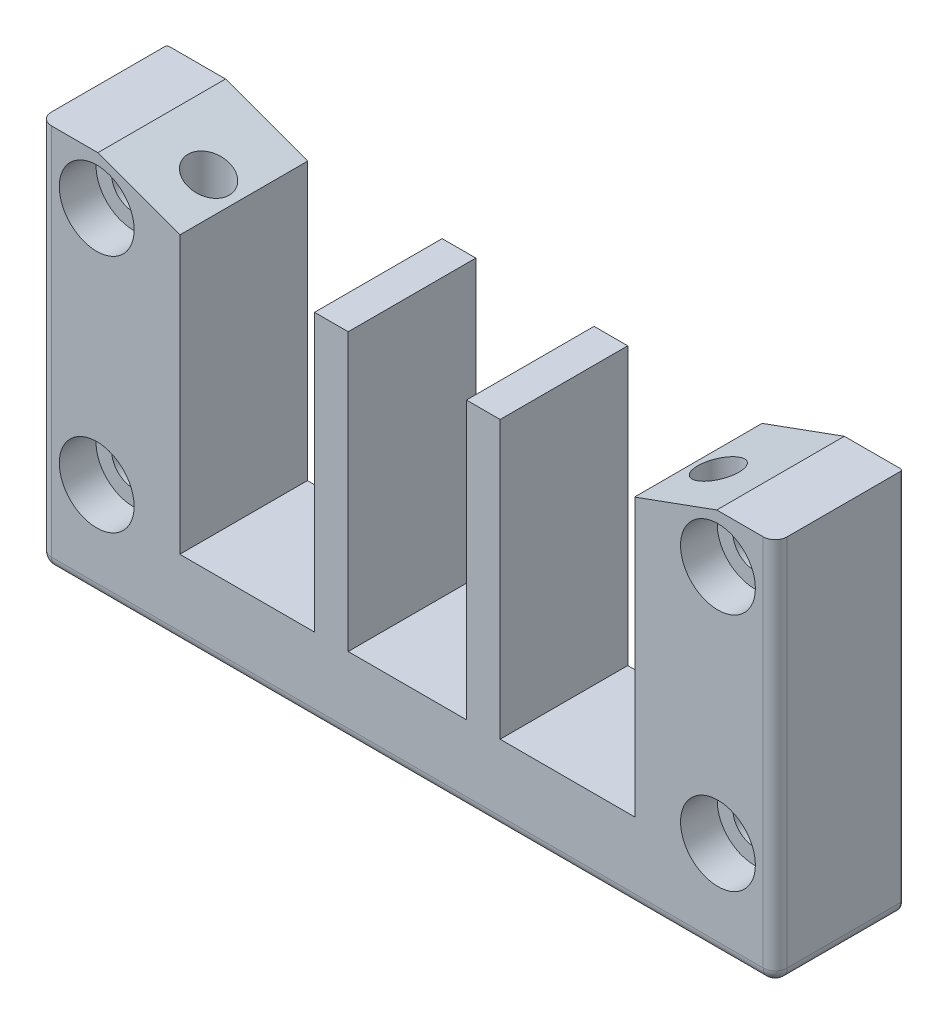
ISO-10303-21;
HEADER;
FILE_DESCRIPTION(('STEP AP214'),'2;1');
FILE_NAME('part.step','',(''),(''),'','','');
FILE_SCHEMA(('AUTOMOTIVE_DESIGN { 1 0 10303 214 1 1 1 1 }'));
ENDSEC;
DATA;
#1=APPLICATION_CONTEXT('core data for automotive mechanical design processes');
#2=APPLICATION_PROTOCOL_DEFINITION('international standard','automotive_design',2000,#1);
#3=PRODUCT_CONTEXT('',#1,'mechanical');
#4=PRODUCT('Part','Part','',(#3));
#5=PRODUCT_RELATED_PRODUCT_CATEGORY('part','',(#4));
#6=PRODUCT_DEFINITION_FORMATION('','',#4);
#7=PRODUCT_DEFINITION_CONTEXT('part definition',#1,'design');
#8=PRODUCT_DEFINITION('design','',#6,#7);
#9=PRODUCT_DEFINITION_SHAPE('','',#8);
#10=(LENGTH_UNIT() NAMED_UNIT(*) SI_UNIT(.MILLI.,.METRE.));
#11=(NAMED_UNIT(*) PLANE_ANGLE_UNIT() SI_UNIT($,.RADIAN.));
#12=(NAMED_UNIT(*) SI_UNIT($,.STERADIAN.) SOLID_ANGLE_UNIT());
#13=UNCERTAINTY_MEASURE_WITH_UNIT(LENGTH_MEASURE(1.E-05),#10,'distance_accuracy_value','');
#14=(GEOMETRIC_REPRESENTATION_CONTEXT(3) GLOBAL_UNCERTAINTY_ASSIGNED_CONTEXT((#13)) GLOBAL_UNIT_ASSIGNED_CONTEXT((#10,
#11,#12)) REPRESENTATION_CONTEXT('',''));
#15=CARTESIAN_POINT('',(0.,0.,0.));
#16=DIRECTION('',(0.,0.,1.));
#17=DIRECTION('',(1.,0.,0.));
#18=AXIS2_PLACEMENT_3D('',#15,#16,#17);
#19=CARTESIAN_POINT('',(-49.15,22.5,-17.05));
#20=DIRECTION('',(0.,1.,0.));
#21=DIRECTION('',(1.,0.,0.));
#22=AXIS2_PLACEMENT_3D('',#19,#20,#21);
#23=PLANE('',#22);
#24=DIRECTION('',(-1.,0.,0.));
#25=VECTOR('',#24,1.);
#26=CARTESIAN_POINT('',(-49.15,22.5,0.));
#27=LINE('',#26,#25);
#28=CARTESIAN_POINT('',(-41.34,22.5,0.));
#29=VERTEX_POINT('',#28);
#30=CARTESIAN_POINT('',(-47.55,22.5,0.));
#31=VERTEX_POINT('',#30);
#32=EDGE_CURVE('E510',#29,#31,#27,.T.);
#33=ORIENTED_EDGE('',*,*,#32,.F.);
#34=DIRECTION('',(0.,0.,1.));
#35=VECTOR('',#34,1.);
#36=CARTESIAN_POINT('',(-41.34,22.5,-17.05));
#37=LINE('',#36,#35);
#38=CARTESIAN_POINT('',(-41.34,22.5,-17.05));
#39=VERTEX_POINT('',#38);
#40=EDGE_CURVE('E10',#39,#29,#37,.T.);
#41=ORIENTED_EDGE('',*,*,#40,.F.);
#42=DIRECTION('',(-1.,0.,0.));
#43=VECTOR('',#42,1.);
#44=CARTESIAN_POINT('',(-49.15,22.5,-17.05));
#45=LINE('',#44,#43);
#46=CARTESIAN_POINT('',(-48.85,22.5,-17.05));
#47=VERTEX_POINT('',#46);
#48=EDGE_CURVE('E529',#39,#47,#45,.T.);
#49=ORIENTED_EDGE('',*,*,#48,.T.);
#50=CARTESIAN_POINT('',(-48.85,22.5,-16.75));
#51=DIRECTION('',(0.,-1.,0.));
#52=DIRECTION('',(0.,0.,1.));
#53=AXIS2_PLACEMENT_3D('',#50,#51,#52);
#54=CIRCLE('',#53,0.3);
#55=CARTESIAN_POINT('',(-49.15,22.5,-16.75));
#56=VERTEX_POINT('',#55);
#57=EDGE_CURVE('E519',#56,#47,#54,.T.);
#58=ORIENTED_EDGE('',*,*,#57,.F.);
#59=DIRECTION('',(0.,0.,1.));
#60=VECTOR('',#59,1.);
#61=CARTESIAN_POINT('',(-49.15,22.5,-17.05));
#62=LINE('',#61,#60);
#63=CARTESIAN_POINT('',(-49.15,22.5,-1.6));
#64=VERTEX_POINT('',#63);
#65=EDGE_CURVE('E541',#56,#64,#62,.T.);
#66=ORIENTED_EDGE('',*,*,#65,.T.);
#67=CARTESIAN_POINT('',(-47.55,22.5,-1.6));
#68=DIRECTION('',(0.,-1.,0.));
#69=DIRECTION('',(0.,0.,1.));
#70=AXIS2_PLACEMENT_3D('',#67,#68,#69);
#71=CIRCLE('',#70,1.6);
#72=EDGE_CURVE('E456',#31,#64,#71,.T.);
#73=ORIENTED_EDGE('',*,*,#72,.F.);
#74=EDGE_LOOP('',(#33,#41,#49,#58,#66,#73));
#75=FACE_BOUND('',#74,.T.);
#76=ADVANCED_FACE('F15',(#75),#23,.T.);
#77=CARTESIAN_POINT('',(-41.34,22.5,-17.05));
#78=DIRECTION('',(0.342020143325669,0.939692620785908,0.));
#79=DIRECTION('',(0.,0.,-1.));
#80=AXIS2_PLACEMENT_3D('',#77,#78,#79);
#81=PLANE('',#80);
#82=CARTESIAN_POINT('',(-36.8,20.8475751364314,-7.5));
#83=CARTESIAN_POINT('',(-36.8,20.8475751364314,-13.));
#84=CARTESIAN_POINT('',(-31.2999999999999,18.8457388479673,-13.));
#85=CARTESIAN_POINT('',(-31.3,18.8457388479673,-7.5));
#86=CARTESIAN_POINT('',(-31.2999999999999,18.8457388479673,-2.00000000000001));
#87=CARTESIAN_POINT('',(-36.8,20.8475751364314,-2.00000000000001));
#88=CARTESIAN_POINT('',(-36.8,20.8475751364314,-7.5));
#89=(BOUNDED_CURVE() B_SPLINE_CURVE(3,(#82,#83,#84,#85,#86,#87,#88),.UNSPECIFIED.,.T.,
.F.) B_SPLINE_CURVE_WITH_KNOTS((4,3,4),(0.,3.1415926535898,6.28318530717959),
.UNSPECIFIED.) CURVE() GEOMETRIC_REPRESENTATION_ITEM() RATIONAL_B_SPLINE_CURVE((1.,
0.333333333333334,0.333333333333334,1.,0.333333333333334,0.333333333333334,1.)) REPRESENTATION_ITEM(''));
#90=CARTESIAN_POINT('',(-36.8,20.8475751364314,-7.5));
#91=VERTEX_POINT('',#90);
#92=EDGE_CURVE('E553',#91,#91,#89,.T.);
#93=ORIENTED_EDGE('',*,*,#92,.T.);
#94=EDGE_LOOP('',(#93));
#95=FACE_BOUND('',#94,.T.);
#96=DIRECTION('',(-0.939692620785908,0.342020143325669,0.));
#97=VECTOR('',#96,1.);
#98=CARTESIAN_POINT('',(-41.34,22.5,0.));
#99=LINE('',#98,#97);
#100=CARTESIAN_POINT('',(-30.3500903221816,18.5,0.));
#101=VERTEX_POINT('',#100);
#102=EDGE_CURVE('E438',#101,#29,#99,.T.);
#103=ORIENTED_EDGE('',*,*,#102,.F.);
#104=DIRECTION('',(0.,0.,1.));
#105=VECTOR('',#104,1.);
#106=CARTESIAN_POINT('',(-30.3500903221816,18.5,-17.05));
#107=LINE('',#106,#105);
#108=CARTESIAN_POINT('',(-30.3500903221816,18.5,-17.05));
#109=VERTEX_POINT('',#108);
#110=EDGE_CURVE('E461',#109,#101,#107,.T.);
#111=ORIENTED_EDGE('',*,*,#110,.F.);
#112=DIRECTION('',(-0.939692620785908,0.342020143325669,0.));
#113=VECTOR('',#112,1.);
#114=CARTESIAN_POINT('',(-41.34,22.5,-17.05));
#115=LINE('',#114,#113);
#116=EDGE_CURVE('E381',#109,#39,#115,.T.);
#117=ORIENTED_EDGE('',*,*,#116,.T.);
#118=ORIENTED_EDGE('',*,*,#40,.T.);
#119=EDGE_LOOP('',(#103,#111,#117,#118));
#120=FACE_BOUND('',#119,.T.);
#121=ADVANCED_FACE('F17',(#95,#120),#81,.T.);
#122=CARTESIAN_POINT('',(41.34,22.5,-17.05));
#123=DIRECTION('',(-0.34202014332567,0.939692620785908,0.));
#124=DIRECTION('',(0.,0.,1.));
#125=AXIS2_PLACEMENT_3D('',#122,#123,#124);
#126=PLANE('',#125);
#127=CARTESIAN_POINT('',(36.8,20.8475751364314,-7.5));
#128=CARTESIAN_POINT('',(36.8,20.8475751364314,-2.00000000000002));
#129=CARTESIAN_POINT('',(31.3,18.8457388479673,-2.00000000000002));
#130=CARTESIAN_POINT('',(31.3,18.8457388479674,-7.5));
#131=CARTESIAN_POINT('',(31.3,18.8457388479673,-13.));
#132=CARTESIAN_POINT('',(36.8,20.8475751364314,-13.));
#133=CARTESIAN_POINT('',(36.8,20.8475751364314,-7.5));
#134=(BOUNDED_CURVE() B_SPLINE_CURVE(3,(#127,#128,#129,#130,#131,#132,#133),.UNSPECIFIED.,.T.,
.F.) B_SPLINE_CURVE_WITH_KNOTS((4,3,4),(0.,3.1415926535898,6.28318530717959),
.UNSPECIFIED.) CURVE() GEOMETRIC_REPRESENTATION_ITEM() RATIONAL_B_SPLINE_CURVE((1.,
0.333333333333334,0.333333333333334,1.,0.333333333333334,0.333333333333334,1.)) REPRESENTATION_ITEM(''));
#135=CARTESIAN_POINT('',(36.8,20.8475751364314,-7.5));
#136=VERTEX_POINT('',#135);
#137=EDGE_CURVE('E33',#136,#136,#134,.T.);
#138=ORIENTED_EDGE('',*,*,#137,.T.);
#139=EDGE_LOOP('',(#138));
#140=FACE_BOUND('',#139,.T.);
#141=DIRECTION('',(-0.939692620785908,-0.34202014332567,0.));
#142=VECTOR('',#141,1.);
#143=CARTESIAN_POINT('',(41.34,22.5,0.));
#144=LINE('',#143,#142);
#145=CARTESIAN_POINT('',(41.34,22.5,0.));
#146=VERTEX_POINT('',#145);
#147=CARTESIAN_POINT('',(30.3500903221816,18.5,0.));
#148=VERTEX_POINT('',#147);
#149=EDGE_CURVE('E506',#146,#148,#144,.T.);
#150=ORIENTED_EDGE('',*,*,#149,.F.);
#151=DIRECTION('',(0.,0.,1.));
#152=VECTOR('',#151,1.);
#153=CARTESIAN_POINT('',(41.34,22.5,-17.05));
#154=LINE('',#153,#152);
#155=CARTESIAN_POINT('',(41.34,22.5,-17.05));
#156=VERTEX_POINT('',#155);
#157=EDGE_CURVE('E24',#156,#146,#154,.T.);
#158=ORIENTED_EDGE('',*,*,#157,.F.);
#159=DIRECTION('',(-0.939692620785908,-0.34202014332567,0.));
#160=VECTOR('',#159,1.);
#161=CARTESIAN_POINT('',(41.34,22.5,-17.05));
#162=LINE('',#161,#160);
#163=CARTESIAN_POINT('',(30.3500903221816,18.5,-17.05));
#164=VERTEX_POINT('',#163);
#165=EDGE_CURVE('E538',#156,#164,#162,.T.);
#166=ORIENTED_EDGE('',*,*,#165,.T.);
#167=DIRECTION('',(0.,0.,1.));
#168=VECTOR('',#167,1.);
#169=CARTESIAN_POINT('',(30.3500903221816,18.5,-17.05));
#170=LINE('',#169,#168);
#171=EDGE_CURVE('E151',#164,#148,#170,.T.);
#172=ORIENTED_EDGE('',*,*,#171,.T.);
#173=EDGE_LOOP('',(#150,#158,#166,#172));
#174=FACE_BOUND('',#173,.T.);
#175=ADVANCED_FACE('F586',(#140,#174),#126,.T.);
#176=CARTESIAN_POINT('',(49.15,22.5,-17.05));
#177=DIRECTION('',(0.,1.,0.));
#178=DIRECTION('',(1.,0.,0.));
#179=AXIS2_PLACEMENT_3D('',#176,#177,#178);
#180=PLANE('',#179);
#181=DIRECTION('',(0.,0.,1.));
#182=VECTOR('',#181,1.);
#183=CARTESIAN_POINT('',(49.15,22.5,-17.05));
#184=LINE('',#183,#182);
#185=CARTESIAN_POINT('',(49.15,22.5,-16.75));
#186=VERTEX_POINT('',#185);
#187=CARTESIAN_POINT('',(49.15,22.5,-1.6));
#188=VERTEX_POINT('',#187);
#189=EDGE_CURVE('E542',#186,#188,#184,.T.);
#190=ORIENTED_EDGE('',*,*,#189,.F.);
#191=CARTESIAN_POINT('',(48.85,22.5,-16.75));
#192=DIRECTION('',(0.,-1.,0.));
#193=DIRECTION('',(-1.,0.,0.));
#194=AXIS2_PLACEMENT_3D('',#191,#192,#193);
#195=CIRCLE('',#194,0.3);
#196=CARTESIAN_POINT('',(48.85,22.5,-17.05));
#197=VERTEX_POINT('',#196);
#198=EDGE_CURVE('E520',#197,#186,#195,.T.);
#199=ORIENTED_EDGE('',*,*,#198,.F.);
#200=DIRECTION('',(-1.,0.,0.));
#201=VECTOR('',#200,1.);
#202=CARTESIAN_POINT('',(49.15,22.5,-17.05));
#203=LINE('',#202,#201);
#204=EDGE_CURVE('E525',#197,#156,#203,.T.);
#205=ORIENTED_EDGE('',*,*,#204,.T.);
#206=ORIENTED_EDGE('',*,*,#157,.T.);
#207=DIRECTION('',(-1.,0.,0.));
#208=VECTOR('',#207,1.);
#209=CARTESIAN_POINT('',(49.15,22.5,0.));
#210=LINE('',#209,#208);
#211=CARTESIAN_POINT('',(47.55,22.5,0.));
#212=VERTEX_POINT('',#211);
#213=EDGE_CURVE('E501',#212,#146,#210,.T.);
#214=ORIENTED_EDGE('',*,*,#213,.F.);
#215=CARTESIAN_POINT('',(47.55,22.5,-1.6));
#216=DIRECTION('',(0.,-1.,0.));
#217=DIRECTION('',(-1.,0.,0.));
#218=AXIS2_PLACEMENT_3D('',#215,#216,#217);
#219=CIRCLE('',#218,1.6);
#220=EDGE_CURVE('E502',#188,#212,#219,.T.);
#221=ORIENTED_EDGE('',*,*,#220,.F.);
#222=EDGE_LOOP('',(#190,#199,#205,#206,#214,#221));
#223=FACE_BOUND('',#222,.T.);
#224=ADVANCED_FACE('F577',(#223),#180,.T.);
#225=CARTESIAN_POINT('',(-30.3500903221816,18.5,-17.05));
#226=DIRECTION('',(0.,1.,0.));
#227=DIRECTION('',(1.,0.,0.));
#228=AXIS2_PLACEMENT_3D('',#225,#226,#227);
#229=PLANE('',#228);
#230=DIRECTION('',(-1.,0.,0.));
#231=VECTOR('',#230,1.);
#232=CARTESIAN_POINT('',(-30.3500903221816,18.5,-17.05));
#233=LINE('',#232,#231);
#234=CARTESIAN_POINT('',(-7.9,18.5,-17.05));
#235=VERTEX_POINT('',#234);
#236=CARTESIAN_POINT('',(-12.4,18.5,-17.05));
#237=VERTEX_POINT('',#236);
#238=EDGE_CURVE('E470',#235,#237,#233,.T.);
#239=ORIENTED_EDGE('',*,*,#238,.T.);
#240=DIRECTION('',(0.,0.,1.));
#241=VECTOR('',#240,1.);
#242=CARTESIAN_POINT('',(-12.4,18.5,-54.3226441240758));
#243=LINE('',#242,#241);
#244=CARTESIAN_POINT('',(-12.4,18.5,0.));
#245=VERTEX_POINT('',#244);
#246=EDGE_CURVE('E476',#237,#245,#243,.T.);
#247=ORIENTED_EDGE('',*,*,#246,.T.);
#248=DIRECTION('',(-1.,0.,0.));
#249=VECTOR('',#248,1.);
#250=CARTESIAN_POINT('',(-30.3500903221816,18.5,0.));
#251=LINE('',#250,#249);
#252=CARTESIAN_POINT('',(-7.9,18.5,0.));
#253=VERTEX_POINT('',#252);
#254=EDGE_CURVE('E434',#253,#245,#251,.T.);
#255=ORIENTED_EDGE('',*,*,#254,.F.);
#256=DIRECTION('',(0.,0.,1.));
#257=VECTOR('',#256,1.);
#258=CARTESIAN_POINT('',(-7.9,18.5,-54.3226441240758));
#259=LINE('',#258,#257);
#260=EDGE_CURVE('E480',#235,#253,#259,.T.);
#261=ORIENTED_EDGE('',*,*,#260,.F.);
#262=EDGE_LOOP('',(#239,#247,#255,#261));
#263=FACE_BOUND('',#262,.T.);
#264=ADVANCED_FACE('F998',(#263),#229,.T.);
#265=CARTESIAN_POINT('',(-30.3500903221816,18.5,-17.05));
#266=DIRECTION('',(0.,1.,0.));
#267=DIRECTION('',(1.,0.,0.));
#268=AXIS2_PLACEMENT_3D('',#265,#266,#267);
#269=PLANE('',#268);
#270=DIRECTION('',(-1.,0.,0.));
#271=VECTOR('',#270,1.);
#272=CARTESIAN_POINT('',(-30.3500903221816,18.5,-17.05));
#273=LINE('',#272,#271);
#274=CARTESIAN_POINT('',(12.4,18.5,-17.05));
#275=VERTEX_POINT('',#274);
#276=CARTESIAN_POINT('',(7.9,18.5,-17.05));
#277=VERTEX_POINT('',#276);
#278=EDGE_CURVE('E473',#275,#277,#273,.T.);
#279=ORIENTED_EDGE('',*,*,#278,.T.);
#280=DIRECTION('',(0.,0.,1.));
#281=VECTOR('',#280,1.);
#282=CARTESIAN_POINT('',(7.9,18.5,-54.3226441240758));
#283=LINE('',#282,#281);
#284=CARTESIAN_POINT('',(7.9,18.5,0.));
#285=VERTEX_POINT('',#284);
#286=EDGE_CURVE('E492',#277,#285,#283,.T.);
#287=ORIENTED_EDGE('',*,*,#286,.T.);
#288=DIRECTION('',(-1.,0.,0.));
#289=VECTOR('',#288,1.);
#290=CARTESIAN_POINT('',(-30.3500903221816,18.5,0.));
#291=LINE('',#290,#289);
#292=CARTESIAN_POINT('',(12.4,18.5,0.));
#293=VERTEX_POINT('',#292);
#294=EDGE_CURVE('E439',#293,#285,#291,.T.);
#295=ORIENTED_EDGE('',*,*,#294,.F.);
#296=DIRECTION('',(0.,0.,1.));
#297=VECTOR('',#296,1.);
#298=CARTESIAN_POINT('',(12.4,18.5,-54.3226441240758));
#299=LINE('',#298,#297);
#300=EDGE_CURVE('E891',#275,#293,#299,.T.);
#301=ORIENTED_EDGE('',*,*,#300,.F.);
#302=EDGE_LOOP('',(#279,#287,#295,#301));
#303=FACE_BOUND('',#302,.T.);
#304=ADVANCED_FACE('F988',(#303),#269,.T.);
#305=CARTESIAN_POINT('',(34.05,29.,-7.5));
#306=DIRECTION('',(0.,1.,0.));
#307=DIRECTION('',(0.,0.,1.));
#308=AXIS2_PLACEMENT_3D('',#305,#306,#307);
#309=CYLINDRICAL_SURFACE('',#308,2.75);
#310=CARTESIAN_POINT('',(34.05,-22.,-7.5));
#311=DIRECTION('',(0.,1.,0.));
#312=DIRECTION('',(0.,0.,-1.));
#313=AXIS2_PLACEMENT_3D('',#310,#311,#312);
#314=CIRCLE('',#313,2.75);
#315=CARTESIAN_POINT('',(34.05,-22.,-10.25));
#316=VERTEX_POINT('',#315);
#317=EDGE_CURVE('E43',#316,#316,#314,.T.);
#318=ORIENTED_EDGE('',*,*,#317,.F.);
#319=EDGE_LOOP('',(#318));
#320=FACE_BOUND('',#319,.T.);
#321=ORIENTED_EDGE('',*,*,#137,.F.);
#322=EDGE_LOOP('',(#321));
#323=FACE_BOUND('',#322,.T.);
#324=ADVANCED_FACE('F1165',(#320,#323),#309,.F.);
#325=CARTESIAN_POINT('',(0.,-22.,0.));
#326=DIRECTION('',(0.,-1.,0.));
#327=DIRECTION('',(0.,0.,-1.));
#328=AXIS2_PLACEMENT_3D('',#325,#326,#327);
#329=PLANE('',#328);
#330=ORIENTED_EDGE('',*,*,#317,.T.);
#331=EDGE_LOOP('',(#330));
#332=FACE_BOUND('',#331,.T.);
#333=DIRECTION('',(1.,0.,0.));
#334=VECTOR('',#333,1.);
#335=CARTESIAN_POINT('',(31.6828638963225,-22.,-11.6));
#336=LINE('',#335,#334);
#337=CARTESIAN_POINT('',(31.6828638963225,-22.,-11.6));
#338=VERTEX_POINT('',#337);
#339=CARTESIAN_POINT('',(36.4171361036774,-22.,-11.6));
#340=VERTEX_POINT('',#339);
#341=EDGE_CURVE('E558',#338,#340,#336,.T.);
#342=ORIENTED_EDGE('',*,*,#341,.T.);
#343=DIRECTION('',(0.5,0.,0.866025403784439));
#344=VECTOR('',#343,1.);
#345=CARTESIAN_POINT('',(36.4171361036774,-22.,-11.6));
#346=LINE('',#345,#344);
#347=CARTESIAN_POINT('',(38.7842722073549,-22.,-7.5));
#348=VERTEX_POINT('',#347);
#349=EDGE_CURVE('E780',#340,#348,#346,.T.);
#350=ORIENTED_EDGE('',*,*,#349,.T.);
#351=DIRECTION('',(-0.5,0.,0.866025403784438));
#352=VECTOR('',#351,1.);
#353=CARTESIAN_POINT('',(38.7842722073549,-22.,-7.5));
#354=LINE('',#353,#352);
#355=CARTESIAN_POINT('',(36.4171361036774,-22.,-3.4));
#356=VERTEX_POINT('',#355);
#357=EDGE_CURVE('E963',#348,#356,#354,.T.);
#358=ORIENTED_EDGE('',*,*,#357,.T.);
#359=DIRECTION('',(-1.,0.,0.));
#360=VECTOR('',#359,1.);
#361=CARTESIAN_POINT('',(36.4171361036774,-22.,-3.4));
#362=LINE('',#361,#360);
#363=CARTESIAN_POINT('',(31.6828638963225,-22.,-3.4));
#364=VERTEX_POINT('',#363);
#365=EDGE_CURVE('E949',#356,#364,#362,.T.);
#366=ORIENTED_EDGE('',*,*,#365,.T.);
#367=DIRECTION('',(-0.5,0.,-0.866025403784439));
#368=VECTOR('',#367,1.);
#369=CARTESIAN_POINT('',(31.6828638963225,-22.,-3.4));
#370=LINE('',#369,#368);
#371=CARTESIAN_POINT('',(29.3157277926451,-22.,-7.5));
#372=VERTEX_POINT('',#371);
#373=EDGE_CURVE('E932',#364,#372,#370,.T.);
#374=ORIENTED_EDGE('',*,*,#373,.T.);
#375=DIRECTION('',(0.5,0.,-0.866025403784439));
#376=VECTOR('',#375,1.);
#377=CARTESIAN_POINT('',(29.3157277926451,-22.,-7.5));
#378=LINE('',#377,#376);
#379=EDGE_CURVE('E908',#372,#338,#378,.T.);
#380=ORIENTED_EDGE('',*,*,#379,.T.);
#381=EDGE_LOOP('',(#342,#350,#358,#366,#374,#380));
#382=FACE_BOUND('',#381,.T.);
#383=ADVANCED_FACE('F1095',(#332,#382),#329,.T.);
#384=CARTESIAN_POINT('',(31.6828638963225,-22.,-11.6));
#385=DIRECTION('',(0.,0.,-1.));
#386=DIRECTION('',(0.,-1.,0.));
#387=AXIS2_PLACEMENT_3D('',#384,#385,#386);
#388=PLANE('',#387);
#389=DIRECTION('',(1.,0.,0.));
#390=VECTOR('',#389,1.);
#391=CARTESIAN_POINT('',(31.6828638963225,-29.,-11.6));
#392=LINE('',#391,#390);
#393=CARTESIAN_POINT('',(31.6828638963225,-29.,-11.6));
#394=VERTEX_POINT('',#393);
#395=CARTESIAN_POINT('',(36.4171361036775,-29.,-11.6));
#396=VERTEX_POINT('',#395);
#397=EDGE_CURVE('E650',#394,#396,#392,.T.);
#398=ORIENTED_EDGE('',*,*,#397,.T.);
#399=DIRECTION('',(0.,-1.,0.));
#400=VECTOR('',#399,1.);
#401=CARTESIAN_POINT('',(36.4171361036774,-22.,-11.6));
#402=LINE('',#401,#400);
#403=EDGE_CURVE('E776',#340,#396,#402,.T.);
#404=ORIENTED_EDGE('',*,*,#403,.F.);
#405=ORIENTED_EDGE('',*,*,#341,.F.);
#406=DIRECTION('',(0.,-1.,0.));
#407=VECTOR('',#406,1.);
#408=CARTESIAN_POINT('',(31.6828638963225,-22.,-11.6));
#409=LINE('',#408,#407);
#410=EDGE_CURVE('E905',#338,#394,#409,.T.);
#411=ORIENTED_EDGE('',*,*,#410,.T.);
#412=EDGE_LOOP('',(#398,#404,#405,#411));
#413=FACE_BOUND('',#412,.T.);
#414=ADVANCED_FACE('F1091',(#413),#388,.F.);
#415=CARTESIAN_POINT('',(-34.05,29.,-7.5));
#416=DIRECTION('',(0.,1.,0.));
#417=DIRECTION('',(0.,0.,1.));
#418=AXIS2_PLACEMENT_3D('',#415,#416,#417);
#419=CYLINDRICAL_SURFACE('',#418,2.75);
#420=CARTESIAN_POINT('',(-34.05,-22.,-7.5));
#421=DIRECTION('',(0.,1.,0.));
#422=DIRECTION('',(0.,0.,-1.));
#423=AXIS2_PLACEMENT_3D('',#420,#421,#422);
#424=CIRCLE('',#423,2.75);
#425=CARTESIAN_POINT('',(-34.05,-22.,-10.25));
#426=VERTEX_POINT('',#425);
#427=EDGE_CURVE('E550',#426,#426,#424,.T.);
#428=ORIENTED_EDGE('',*,*,#427,.F.);
#429=EDGE_LOOP('',(#428));
#430=FACE_BOUND('',#429,.T.);
#431=ORIENTED_EDGE('',*,*,#92,.F.);
#432=EDGE_LOOP('',(#431));
#433=FACE_BOUND('',#432,.T.);
#434=ADVANCED_FACE('F1094',(#430,#433),#419,.F.);
#435=CARTESIAN_POINT('',(0.,-22.,0.));
#436=DIRECTION('',(0.,-1.,0.));
#437=DIRECTION('',(0.,0.,-1.));
#438=AXIS2_PLACEMENT_3D('',#435,#436,#437);
#439=PLANE('',#438);
#440=ORIENTED_EDGE('',*,*,#427,.T.);
#441=EDGE_LOOP('',(#440));
#442=FACE_BOUND('',#441,.T.);
#443=DIRECTION('',(1.,0.,0.));
#444=VECTOR('',#443,1.);
#445=CARTESIAN_POINT('',(-36.4171361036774,-22.,-11.6));
#446=LINE('',#445,#444);
#447=CARTESIAN_POINT('',(-36.4171361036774,-22.,-11.6));
#448=VERTEX_POINT('',#447);
#449=CARTESIAN_POINT('',(-31.6828638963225,-22.,-11.6));
#450=VERTEX_POINT('',#449);
#451=EDGE_CURVE('E547',#448,#450,#446,.T.);
#452=ORIENTED_EDGE('',*,*,#451,.T.);
#453=DIRECTION('',(0.5,0.,0.866025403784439));
#454=VECTOR('',#453,1.);
#455=CARTESIAN_POINT('',(-31.6828638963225,-22.,-11.6));
#456=LINE('',#455,#454);
#457=CARTESIAN_POINT('',(-29.315727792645,-22.,-7.5));
#458=VERTEX_POINT('',#457);
#459=EDGE_CURVE('E613',#450,#458,#456,.T.);
#460=ORIENTED_EDGE('',*,*,#459,.T.);
#461=DIRECTION('',(-0.5,0.,0.866025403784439));
#462=VECTOR('',#461,1.);
#463=CARTESIAN_POINT('',(-29.315727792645,-22.,-7.5));
#464=LINE('',#463,#462);
#465=CARTESIAN_POINT('',(-31.6828638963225,-22.,-3.4));
#466=VERTEX_POINT('',#465);
#467=EDGE_CURVE('E600',#458,#466,#464,.T.);
#468=ORIENTED_EDGE('',*,*,#467,.T.);
#469=DIRECTION('',(-1.,0.,0.));
#470=VECTOR('',#469,1.);
#471=CARTESIAN_POINT('',(-31.6828638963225,-22.,-3.4));
#472=LINE('',#471,#470);
#473=CARTESIAN_POINT('',(-36.4171361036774,-22.,-3.4));
#474=VERTEX_POINT('',#473);
#475=EDGE_CURVE('E820',#466,#474,#472,.T.);
#476=ORIENTED_EDGE('',*,*,#475,.T.);
#477=DIRECTION('',(-0.5,0.,-0.866025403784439));
#478=VECTOR('',#477,1.);
#479=CARTESIAN_POINT('',(-36.4171361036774,-22.,-3.4));
#480=LINE('',#479,#478);
#481=CARTESIAN_POINT('',(-38.7842722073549,-22.,-7.5));
#482=VERTEX_POINT('',#481);
#483=EDGE_CURVE('E805',#474,#482,#480,.T.);
#484=ORIENTED_EDGE('',*,*,#483,.T.);
#485=DIRECTION('',(0.5,0.,-0.866025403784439));
#486=VECTOR('',#485,1.);
#487=CARTESIAN_POINT('',(-38.7842722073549,-22.,-7.5));
#488=LINE('',#487,#486);
#489=EDGE_CURVE('E791',#482,#448,#488,.T.);
#490=ORIENTED_EDGE('',*,*,#489,.T.);
#491=EDGE_LOOP('',(#452,#460,#468,#476,#484,#490));
#492=FACE_BOUND('',#491,.T.);
#493=ADVANCED_FACE('F843',(#442,#492),#439,.T.);
#494=CARTESIAN_POINT('',(-36.4171361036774,-22.,-11.6));
#495=DIRECTION('',(0.,0.,-1.));
#496=DIRECTION('',(-1.,0.,0.));
#497=AXIS2_PLACEMENT_3D('',#494,#495,#496);
#498=PLANE('',#497);
#499=DIRECTION('',(1.,0.,0.));
#500=VECTOR('',#499,1.);
#501=CARTESIAN_POINT('',(-36.4171361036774,-29.,-11.6));
#502=LINE('',#501,#500);
#503=CARTESIAN_POINT('',(-36.4171361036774,-29.,-11.6));
#504=VERTEX_POINT('',#503);
#505=CARTESIAN_POINT('',(-31.6828638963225,-29.,-11.6));
#506=VERTEX_POINT('',#505);
#507=EDGE_CURVE('E657',#504,#506,#502,.T.);
#508=ORIENTED_EDGE('',*,*,#507,.T.);
#509=DIRECTION('',(0.,-1.,0.));
#510=VECTOR('',#509,1.);
#511=CARTESIAN_POINT('',(-31.6828638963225,-22.,-11.6));
#512=LINE('',#511,#510);
#513=EDGE_CURVE('E616',#450,#506,#512,.T.);
#514=ORIENTED_EDGE('',*,*,#513,.F.);
#515=ORIENTED_EDGE('',*,*,#451,.F.);
#516=DIRECTION('',(0.,-1.,0.));
#517=VECTOR('',#516,1.);
#518=CARTESIAN_POINT('',(-36.4171361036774,-22.,-11.6));
#519=LINE('',#518,#517);
#520=EDGE_CURVE('E784',#448,#504,#519,.T.);
#521=ORIENTED_EDGE('',*,*,#520,.T.);
#522=EDGE_LOOP('',(#508,#514,#515,#521));
#523=FACE_BOUND('',#522,.T.);
#524=ADVANCED_FACE('F1156',(#523),#498,.F.);
#525=CARTESIAN_POINT('',(-30.4,18.5,-17.05));
#526=DIRECTION('',(0.,1.,0.));
#527=DIRECTION('',(1.,0.,0.));
#528=AXIS2_PLACEMENT_3D('',#525,#526,#527);
#529=PLANE('',#528);
#530=ORIENTED_EDGE('',*,*,#171,.F.);
#531=DIRECTION('',(-1.,0.,0.));
#532=VECTOR('',#531,1.);
#533=CARTESIAN_POINT('',(-30.4,18.5,-17.05));
#534=LINE('',#533,#532);
#535=CARTESIAN_POINT('',(30.4,18.5,-17.05));
#536=VERTEX_POINT('',#535);
#537=EDGE_CURVE('E534',#536,#164,#534,.T.);
#538=ORIENTED_EDGE('',*,*,#537,.F.);
#539=DIRECTION('',(0.,0.,1.));
#540=VECTOR('',#539,1.);
#541=CARTESIAN_POINT('',(30.4,18.5,-17.05));
#542=LINE('',#541,#540);
#543=CARTESIAN_POINT('',(30.4,18.5,0.));
#544=VERTEX_POINT('',#543);
#545=EDGE_CURVE('E666',#536,#544,#542,.T.);
#546=ORIENTED_EDGE('',*,*,#545,.T.);
#547=DIRECTION('',(-1.,0.,0.));
#548=VECTOR('',#547,1.);
#549=CARTESIAN_POINT('',(-30.4,18.5,0.));
#550=LINE('',#549,#548);
#551=EDGE_CURVE('E503',#544,#148,#550,.T.);
#552=ORIENTED_EDGE('',*,*,#551,.T.);
#553=EDGE_LOOP('',(#530,#538,#546,#552));
#554=FACE_BOUND('',#553,.T.);
#555=ADVANCED_FACE('F884',(#554),#529,.F.);
#556=CARTESIAN_POINT('',(49.15,29.,-17.05));
#557=DIRECTION('',(1.,0.,0.));
#558=DIRECTION('',(0.,1.,0.));
#559=AXIS2_PLACEMENT_3D('',#556,#557,#558);
#560=PLANE('',#559);
#561=DIRECTION('',(0.,1.,0.));
#562=VECTOR('',#561,1.);
#563=CARTESIAN_POINT('',(49.15,27.4,-16.75));
#564=LINE('',#563,#562);
#565=CARTESIAN_POINT('',(49.15,-27.4,-16.75));
#566=VERTEX_POINT('',#565);
#567=EDGE_CURVE('E524',#566,#186,#564,.T.);
#568=ORIENTED_EDGE('',*,*,#567,.T.);
#569=ORIENTED_EDGE('',*,*,#189,.T.);
#570=DIRECTION('',(0.,-1.,0.));
#571=VECTOR('',#570,1.);
#572=CARTESIAN_POINT('',(49.15,29.,-1.6));
#573=LINE('',#572,#571);
#574=CARTESIAN_POINT('',(49.15,-27.4,-1.6));
#575=VERTEX_POINT('',#574);
#576=EDGE_CURVE('E660',#188,#575,#573,.T.);
#577=ORIENTED_EDGE('',*,*,#576,.T.);
#578=DIRECTION('',(0.,0.,-1.));
#579=VECTOR('',#578,1.);
#580=CARTESIAN_POINT('',(49.15,-27.4,-17.05));
#581=LINE('',#580,#579);
#582=EDGE_CURVE('E695',#575,#566,#581,.T.);
#583=ORIENTED_EDGE('',*,*,#582,.T.);
#584=EDGE_LOOP('',(#568,#569,#577,#583));
#585=FACE_BOUND('',#584,.T.);
#586=ADVANCED_FACE('F1150',(#585),#560,.T.);
#587=CARTESIAN_POINT('',(-49.15,29.,-17.05));
#588=DIRECTION('',(-1.,0.,0.));
#589=DIRECTION('',(0.,1.,0.));
#590=AXIS2_PLACEMENT_3D('',#587,#588,#589);
#591=PLANE('',#590);
#592=DIRECTION('',(0.,1.,0.));
#593=VECTOR('',#592,1.);
#594=CARTESIAN_POINT('',(-49.15,29.,-1.6));
#595=LINE('',#594,#593);
#596=CARTESIAN_POINT('',(-49.15,-27.4,-1.6));
#597=VERTEX_POINT('',#596);
#598=EDGE_CURVE('E457',#597,#64,#595,.T.);
#599=ORIENTED_EDGE('',*,*,#598,.T.);
#600=ORIENTED_EDGE('',*,*,#65,.F.);
#601=DIRECTION('',(0.,-1.,0.));
#602=VECTOR('',#601,1.);
#603=CARTESIAN_POINT('',(-49.15,-27.4,-16.75));
#604=LINE('',#603,#602);
#605=CARTESIAN_POINT('',(-49.15,-27.4,-16.75));
#606=VERTEX_POINT('',#605);
#607=EDGE_CURVE('E513',#56,#606,#604,.T.);
#608=ORIENTED_EDGE('',*,*,#607,.T.);
#609=DIRECTION('',(0.,0.,1.));
#610=VECTOR('',#609,1.);
#611=CARTESIAN_POINT('',(-49.15,-27.4,-17.05));
#612=LINE('',#611,#610);
#613=EDGE_CURVE('E700',#606,#597,#612,.T.);
#614=ORIENTED_EDGE('',*,*,#613,.T.);
#615=EDGE_LOOP('',(#599,#600,#608,#614));
#616=FACE_BOUND('',#615,.T.);
#617=ADVANCED_FACE('F1148',(#616),#591,.T.);
#618=CARTESIAN_POINT('',(0.,0.,-17.05));
#619=DIRECTION('',(0.,0.,1.));
#620=DIRECTION('',(1.,0.,0.));
#621=AXIS2_PLACEMENT_3D('',#618,#619,#620);
#622=PLANE('',#621);
#623=CARTESIAN_POINT('',(-41.5,16.,-17.05));
#624=DIRECTION('',(0.,0.,1.));
#625=DIRECTION('',(1.,0.,0.));
#626=AXIS2_PLACEMENT_3D('',#623,#624,#625);
#627=CIRCLE('',#626,2.9);
#628=CARTESIAN_POINT('',(-38.6,16.,-17.05));
#629=VERTEX_POINT('',#628);
#630=EDGE_CURVE('E602',#629,#629,#627,.T.);
#631=ORIENTED_EDGE('',*,*,#630,.T.);
#632=EDGE_LOOP('',(#631));
#633=FACE_BOUND('',#632,.T.);
#634=CARTESIAN_POINT('',(-41.5,-16.,-17.05));
#635=DIRECTION('',(0.,0.,1.));
#636=DIRECTION('',(1.,0.,0.));
#637=AXIS2_PLACEMENT_3D('',#634,#635,#636);
#638=CIRCLE('',#637,2.9);
#639=CARTESIAN_POINT('',(-38.6,-16.,-17.05));
#640=VERTEX_POINT('',#639);
#641=EDGE_CURVE('E604',#640,#640,#638,.T.);
#642=ORIENTED_EDGE('',*,*,#641,.T.);
#643=EDGE_LOOP('',(#642));
#644=FACE_BOUND('',#643,.T.);
#645=CARTESIAN_POINT('',(41.5,-16.,-17.05));
#646=DIRECTION('',(0.,0.,1.));
#647=DIRECTION('',(1.,0.,0.));
#648=AXIS2_PLACEMENT_3D('',#645,#646,#647);
#649=CIRCLE('',#648,2.9);
#650=CARTESIAN_POINT('',(44.4,-16.,-17.05));
#651=VERTEX_POINT('',#650);
#652=EDGE_CURVE('E731',#651,#651,#649,.T.);
#653=ORIENTED_EDGE('',*,*,#652,.T.);
#654=EDGE_LOOP('',(#653));
#655=FACE_BOUND('',#654,.T.);
#656=CARTESIAN_POINT('',(41.5,16.,-17.05));
#657=DIRECTION('',(0.,0.,1.));
#658=DIRECTION('',(1.,0.,0.));
#659=AXIS2_PLACEMENT_3D('',#656,#657,#658);
#660=CIRCLE('',#659,2.9);
#661=CARTESIAN_POINT('',(44.4,16.,-17.05));
#662=VERTEX_POINT('',#661);
#663=EDGE_CURVE('E637',#662,#662,#660,.T.);
#664=ORIENTED_EDGE('',*,*,#663,.T.);
#665=EDGE_LOOP('',(#664));
#666=FACE_BOUND('',#665,.T.);
#667=ORIENTED_EDGE('',*,*,#204,.F.);
#668=DIRECTION('',(0.,-1.,0.));
#669=VECTOR('',#668,1.);
#670=CARTESIAN_POINT('',(48.85,-27.4,-17.05));
#671=LINE('',#670,#669);
#672=CARTESIAN_POINT('',(48.85,-27.4,-17.05));
#673=VERTEX_POINT('',#672);
#674=EDGE_CURVE('E518',#197,#673,#671,.T.);
#675=ORIENTED_EDGE('',*,*,#674,.T.);
#676=CARTESIAN_POINT('',(47.55,-27.4,-17.05));
#677=DIRECTION('',(0.,0.,-1.));
#678=DIRECTION('',(1.,0.,0.));
#679=AXIS2_PLACEMENT_3D('',#676,#677,#678);
#680=CIRCLE('',#679,1.3);
#681=CARTESIAN_POINT('',(47.55,-28.7,-17.05));
#682=VERTEX_POINT('',#681);
#683=EDGE_CURVE('E420',#673,#682,#680,.T.);
#684=ORIENTED_EDGE('',*,*,#683,.T.);
#685=DIRECTION('',(-1.,0.,0.));
#686=VECTOR('',#685,1.);
#687=CARTESIAN_POINT('',(-47.55,-28.7,-17.05));
#688=LINE('',#687,#686);
#689=CARTESIAN_POINT('',(-47.55,-28.7,-17.05));
#690=VERTEX_POINT('',#689);
#691=EDGE_CURVE('E720',#682,#690,#688,.T.);
#692=ORIENTED_EDGE('',*,*,#691,.T.);
#693=CARTESIAN_POINT('',(-47.55,-27.4,-17.05));
#694=DIRECTION('',(0.,0.,-1.));
#695=DIRECTION('',(1.,0.,0.));
#696=AXIS2_PLACEMENT_3D('',#693,#694,#695);
#697=CIRCLE('',#696,1.3);
#698=CARTESIAN_POINT('',(-48.85,-27.4,-17.05));
#699=VERTEX_POINT('',#698);
#700=EDGE_CURVE('E716',#690,#699,#697,.T.);
#701=ORIENTED_EDGE('',*,*,#700,.T.);
#702=DIRECTION('',(0.,1.,0.));
#703=VECTOR('',#702,1.);
#704=CARTESIAN_POINT('',(-48.85,27.4,-17.05));
#705=LINE('',#704,#703);
#706=EDGE_CURVE('E514',#699,#47,#705,.T.);
#707=ORIENTED_EDGE('',*,*,#706,.T.);
#708=ORIENTED_EDGE('',*,*,#48,.F.);
#709=ORIENTED_EDGE('',*,*,#116,.F.);
#710=DIRECTION('',(-1.,0.,0.));
#711=VECTOR('',#710,1.);
#712=CARTESIAN_POINT('',(-30.4,18.5,-17.05));
#713=LINE('',#712,#711);
#714=CARTESIAN_POINT('',(-30.4,18.5,-17.05));
#715=VERTEX_POINT('',#714);
#716=EDGE_CURVE('E373',#109,#715,#713,.T.);
#717=ORIENTED_EDGE('',*,*,#716,.T.);
#718=DIRECTION('',(0.,-1.,0.));
#719=VECTOR('',#718,1.);
#720=CARTESIAN_POINT('',(-30.4,18.5,-17.05));
#721=LINE('',#720,#719);
#722=CARTESIAN_POINT('',(-30.4,-18.5,-17.05));
#723=VERTEX_POINT('',#722);
#724=EDGE_CURVE('E378',#715,#723,#721,.T.);
#725=ORIENTED_EDGE('',*,*,#724,.T.);
#726=DIRECTION('',(1.,0.,0.));
#727=VECTOR('',#726,1.);
#728=CARTESIAN_POINT('',(-30.4,-18.5,-17.05));
#729=LINE('',#728,#727);
#730=CARTESIAN_POINT('',(-12.4,-18.5,-17.05));
#731=VERTEX_POINT('',#730);
#732=EDGE_CURVE('E425',#723,#731,#729,.T.);
#733=ORIENTED_EDGE('',*,*,#732,.T.);
#734=DIRECTION('',(0.,1.,0.));
#735=VECTOR('',#734,1.);
#736=CARTESIAN_POINT('',(-12.4,18.5,-17.05));
#737=LINE('',#736,#735);
#738=EDGE_CURVE('E386',#731,#237,#737,.T.);
#739=ORIENTED_EDGE('',*,*,#738,.T.);
#740=ORIENTED_EDGE('',*,*,#238,.F.);
#741=DIRECTION('',(0.,-1.,0.));
#742=VECTOR('',#741,1.);
#743=CARTESIAN_POINT('',(-7.9,18.5,-17.05));
#744=LINE('',#743,#742);
#745=CARTESIAN_POINT('',(-7.9,-18.5,-17.05));
#746=VERTEX_POINT('',#745);
#747=EDGE_CURVE('E477',#235,#746,#744,.T.);
#748=ORIENTED_EDGE('',*,*,#747,.T.);
#749=DIRECTION('',(1.,0.,0.));
#750=VECTOR('',#749,1.);
#751=CARTESIAN_POINT('',(-30.4,-18.5,-17.05));
#752=LINE('',#751,#750);
#753=CARTESIAN_POINT('',(7.9,-18.5,-17.05));
#754=VERTEX_POINT('',#753);
#755=EDGE_CURVE('E444',#746,#754,#752,.T.);
#756=ORIENTED_EDGE('',*,*,#755,.T.);
#757=DIRECTION('',(0.,1.,0.));
#758=VECTOR('',#757,1.);
#759=CARTESIAN_POINT('',(7.9,18.5,-17.05));
#760=LINE('',#759,#758);
#761=EDGE_CURVE('E488',#754,#277,#760,.T.);
#762=ORIENTED_EDGE('',*,*,#761,.T.);
#763=ORIENTED_EDGE('',*,*,#278,.F.);
#764=DIRECTION('',(0.,-1.,0.));
#765=VECTOR('',#764,1.);
#766=CARTESIAN_POINT('',(12.4,18.5,-17.05));
#767=LINE('',#766,#765);
#768=CARTESIAN_POINT('',(12.4,-18.5,-17.05));
#769=VERTEX_POINT('',#768);
#770=EDGE_CURVE('E496',#275,#769,#767,.T.);
#771=ORIENTED_EDGE('',*,*,#770,.T.);
#772=DIRECTION('',(1.,0.,0.));
#773=VECTOR('',#772,1.);
#774=CARTESIAN_POINT('',(-30.4,-18.5,-17.05));
#775=LINE('',#774,#773);
#776=CARTESIAN_POINT('',(30.4,-18.5,-17.05));
#777=VERTEX_POINT('',#776);
#778=EDGE_CURVE('E426',#769,#777,#775,.T.);
#779=ORIENTED_EDGE('',*,*,#778,.T.);
#780=DIRECTION('',(0.,1.,0.));
#781=VECTOR('',#780,1.);
#782=CARTESIAN_POINT('',(30.4,18.5,-17.05));
#783=LINE('',#782,#781);
#784=EDGE_CURVE('E661',#777,#536,#783,.T.);
#785=ORIENTED_EDGE('',*,*,#784,.T.);
#786=ORIENTED_EDGE('',*,*,#537,.T.);
#787=ORIENTED_EDGE('',*,*,#165,.F.);
#788=EDGE_LOOP('',(#667,#675,#684,#692,#701,#707,#708,#709,#717,#725,#733,#739,#740,#748,#756,
#762,#763,#771,#779,#785,#786,#787));
#789=FACE_BOUND('',#788,.T.);
#790=ADVANCED_FACE('F375',(#633,#644,#655,#666,#789),#622,.F.);
#791=CARTESIAN_POINT('',(48.85,29.,-16.75));
#792=DIRECTION('',(0.,-1.,0.));
#793=DIRECTION('',(1.,0.,0.));
#794=AXIS2_PLACEMENT_3D('',#791,#792,#793);
#795=CYLINDRICAL_SURFACE('',#794,0.3);
#796=ORIENTED_EDGE('',*,*,#674,.F.);
#797=ORIENTED_EDGE('',*,*,#198,.T.);
#798=ORIENTED_EDGE('',*,*,#567,.F.);
#799=CARTESIAN_POINT('',(48.85,-27.4,-16.75));
#800=DIRECTION('',(0.,1.,0.));
#801=DIRECTION('',(0.,0.,1.));
#802=AXIS2_PLACEMENT_3D('',#799,#800,#801);
#803=CIRCLE('',#802,0.3);
#804=EDGE_CURVE('E415',#566,#673,#803,.T.);
#805=ORIENTED_EDGE('',*,*,#804,.T.);
#806=EDGE_LOOP('',(#796,#797,#798,#805));
#807=FACE_BOUND('',#806,.T.);
#808=ADVANCED_FACE('F1141',(#807),#795,.T.);
#809=CARTESIAN_POINT('',(-48.85,29.,-16.75));
#810=DIRECTION('',(0.,1.,0.));
#811=DIRECTION('',(-1.,0.,0.));
#812=AXIS2_PLACEMENT_3D('',#809,#810,#811);
#813=CYLINDRICAL_SURFACE('',#812,0.3);
#814=ORIENTED_EDGE('',*,*,#607,.F.);
#815=ORIENTED_EDGE('',*,*,#57,.T.);
#816=ORIENTED_EDGE('',*,*,#706,.F.);
#817=CARTESIAN_POINT('',(-48.85,-27.4,-16.75));
#818=DIRECTION('',(0.,1.,0.));
#819=DIRECTION('',(0.,0.,1.));
#820=AXIS2_PLACEMENT_3D('',#817,#818,#819);
#821=CIRCLE('',#820,0.3);
#822=EDGE_CURVE('E710',#699,#606,#821,.T.);
#823=ORIENTED_EDGE('',*,*,#822,.T.);
#824=EDGE_LOOP('',(#814,#815,#816,#823));
#825=FACE_BOUND('',#824,.T.);
#826=ADVANCED_FACE('F1131',(#825),#813,.T.);
#827=CARTESIAN_POINT('',(0.,0.,0.));
#828=DIRECTION('',(0.,0.,1.));
#829=DIRECTION('',(1.,0.,0.));
#830=AXIS2_PLACEMENT_3D('',#827,#828,#829);
#831=PLANE('',#830);
#832=CARTESIAN_POINT('',(-41.5,16.,0.));
#833=DIRECTION('',(0.,0.,1.));
#834=DIRECTION('',(1.,0.,0.));
#835=AXIS2_PLACEMENT_3D('',#832,#833,#834);
#836=CIRCLE('',#835,5.);
#837=CARTESIAN_POINT('',(-36.5,16.,0.));
#838=VERTEX_POINT('',#837);
#839=EDGE_CURVE('E749',#838,#838,#836,.T.);
#840=ORIENTED_EDGE('',*,*,#839,.F.);
#841=EDGE_LOOP('',(#840));
#842=FACE_BOUND('',#841,.T.);
#843=CARTESIAN_POINT('',(-41.5,-16.,0.));
#844=DIRECTION('',(0.,0.,1.));
#845=DIRECTION('',(1.,0.,0.));
#846=AXIS2_PLACEMENT_3D('',#843,#844,#845);
#847=CIRCLE('',#846,5.);
#848=CARTESIAN_POINT('',(-36.5,-16.,0.));
#849=VERTEX_POINT('',#848);
#850=EDGE_CURVE('E755',#849,#849,#847,.T.);
#851=ORIENTED_EDGE('',*,*,#850,.F.);
#852=EDGE_LOOP('',(#851));
#853=FACE_BOUND('',#852,.T.);
#854=CARTESIAN_POINT('',(41.5,-16.,0.));
#855=DIRECTION('',(0.,0.,1.));
#856=DIRECTION('',(1.,0.,0.));
#857=AXIS2_PLACEMENT_3D('',#854,#855,#856);
#858=CIRCLE('',#857,5.);
#859=CARTESIAN_POINT('',(46.5,-16.,0.));
#860=VERTEX_POINT('',#859);
#861=EDGE_CURVE('E758',#860,#860,#858,.T.);
#862=ORIENTED_EDGE('',*,*,#861,.F.);
#863=EDGE_LOOP('',(#862));
#864=FACE_BOUND('',#863,.T.);
#865=CARTESIAN_POINT('',(41.5,16.,0.));
#866=DIRECTION('',(0.,0.,1.));
#867=DIRECTION('',(1.,0.,0.));
#868=AXIS2_PLACEMENT_3D('',#865,#866,#867);
#869=CIRCLE('',#868,5.);
#870=CARTESIAN_POINT('',(46.5,16.,0.));
#871=VERTEX_POINT('',#870);
#872=EDGE_CURVE('E763',#871,#871,#869,.T.);
#873=ORIENTED_EDGE('',*,*,#872,.F.);
#874=EDGE_LOOP('',(#873));
#875=FACE_BOUND('',#874,.T.);
#876=DIRECTION('',(0.,1.,0.));
#877=VECTOR('',#876,1.);
#878=CARTESIAN_POINT('',(47.55,0.,0.));
#879=LINE('',#878,#877);
#880=CARTESIAN_POINT('',(47.55,-27.4,0.));
#881=VERTEX_POINT('',#880);
#882=EDGE_CURVE('E497',#881,#212,#879,.T.);
#883=ORIENTED_EDGE('',*,*,#882,.T.);
#884=ORIENTED_EDGE('',*,*,#213,.T.);
#885=ORIENTED_EDGE('',*,*,#149,.T.);
#886=ORIENTED_EDGE('',*,*,#551,.F.);
#887=DIRECTION('',(0.,1.,0.));
#888=VECTOR('',#887,1.);
#889=CARTESIAN_POINT('',(30.4,18.5,0.));
#890=LINE('',#889,#888);
#891=CARTESIAN_POINT('',(30.4,-18.5,0.));
#892=VERTEX_POINT('',#891);
#893=EDGE_CURVE('E653',#892,#544,#890,.T.);
#894=ORIENTED_EDGE('',*,*,#893,.F.);
#895=DIRECTION('',(1.,0.,0.));
#896=VECTOR('',#895,1.);
#897=CARTESIAN_POINT('',(-30.4,-18.5,0.));
#898=LINE('',#897,#896);
#899=CARTESIAN_POINT('',(12.4,-18.5,0.));
#900=VERTEX_POINT('',#899);
#901=EDGE_CURVE('E433',#900,#892,#898,.T.);
#902=ORIENTED_EDGE('',*,*,#901,.F.);
#903=DIRECTION('',(0.,1.,0.));
#904=VECTOR('',#903,1.);
#905=CARTESIAN_POINT('',(12.4,18.5,0.));
#906=LINE('',#905,#904);
#907=EDGE_CURVE('E737',#900,#293,#906,.T.);
#908=ORIENTED_EDGE('',*,*,#907,.T.);
#909=ORIENTED_EDGE('',*,*,#294,.T.);
#910=DIRECTION('',(0.,-1.,0.));
#911=VECTOR('',#910,1.);
#912=CARTESIAN_POINT('',(7.9,18.5,0.));
#913=LINE('',#912,#911);
#914=CARTESIAN_POINT('',(7.9,-18.5,0.));
#915=VERTEX_POINT('',#914);
#916=EDGE_CURVE('E489',#285,#915,#913,.T.);
#917=ORIENTED_EDGE('',*,*,#916,.T.);
#918=DIRECTION('',(1.,0.,0.));
#919=VECTOR('',#918,1.);
#920=CARTESIAN_POINT('',(-30.4,-18.5,0.));
#921=LINE('',#920,#919);
#922=CARTESIAN_POINT('',(-7.9,-18.5,0.));
#923=VERTEX_POINT('',#922);
#924=EDGE_CURVE('E443',#923,#915,#921,.T.);
#925=ORIENTED_EDGE('',*,*,#924,.F.);
#926=DIRECTION('',(0.,1.,0.));
#927=VECTOR('',#926,1.);
#928=CARTESIAN_POINT('',(-7.9,18.5,0.));
#929=LINE('',#928,#927);
#930=EDGE_CURVE('E484',#923,#253,#929,.T.);
#931=ORIENTED_EDGE('',*,*,#930,.T.);
#932=ORIENTED_EDGE('',*,*,#254,.T.);
#933=DIRECTION('',(0.,-1.,0.));
#934=VECTOR('',#933,1.);
#935=CARTESIAN_POINT('',(-12.4,18.5,0.));
#936=LINE('',#935,#934);
#937=CARTESIAN_POINT('',(-12.4,-18.5,0.));
#938=VERTEX_POINT('',#937);
#939=EDGE_CURVE('E469',#245,#938,#936,.T.);
#940=ORIENTED_EDGE('',*,*,#939,.T.);
#941=DIRECTION('',(1.,0.,0.));
#942=VECTOR('',#941,1.);
#943=CARTESIAN_POINT('',(-30.4,-18.5,0.));
#944=LINE('',#943,#942);
#945=CARTESIAN_POINT('',(-30.4,-18.5,0.));
#946=VERTEX_POINT('',#945);
#947=EDGE_CURVE('E419',#946,#938,#944,.T.);
#948=ORIENTED_EDGE('',*,*,#947,.F.);
#949=DIRECTION('',(0.,-1.,0.));
#950=VECTOR('',#949,1.);
#951=CARTESIAN_POINT('',(-30.4,18.5,0.));
#952=LINE('',#951,#950);
#953=CARTESIAN_POINT('',(-30.4,18.5,0.));
#954=VERTEX_POINT('',#953);
#955=EDGE_CURVE('E408',#954,#946,#952,.T.);
#956=ORIENTED_EDGE('',*,*,#955,.F.);
#957=DIRECTION('',(-1.,0.,0.));
#958=VECTOR('',#957,1.);
#959=CARTESIAN_POINT('',(-30.4,18.5,0.));
#960=LINE('',#959,#958);
#961=EDGE_CURVE('E387',#101,#954,#960,.T.);
#962=ORIENTED_EDGE('',*,*,#961,.F.);
#963=ORIENTED_EDGE('',*,*,#102,.T.);
#964=ORIENTED_EDGE('',*,*,#32,.T.);
#965=DIRECTION('',(0.,-1.,0.));
#966=VECTOR('',#965,1.);
#967=CARTESIAN_POINT('',(-47.55,0.,0.));
#968=LINE('',#967,#966);
#969=CARTESIAN_POINT('',(-47.55,-27.4,0.));
#970=VERTEX_POINT('',#969);
#971=EDGE_CURVE('E453',#31,#970,#968,.T.);
#972=ORIENTED_EDGE('',*,*,#971,.T.);
#973=DIRECTION('',(1.,0.,0.));
#974=VECTOR('',#973,1.);
#975=CARTESIAN_POINT('',(0.,-27.4,0.));
#976=LINE('',#975,#974);
#977=EDGE_CURVE('E646',#970,#881,#976,.T.);
#978=ORIENTED_EDGE('',*,*,#977,.T.);
#979=EDGE_LOOP('',(#883,#884,#885,#886,#894,#902,#908,#909,#917,#925,#931,#932,#940,#948,#956,
#962,#963,#964,#972,#978));
#980=FACE_BOUND('',#979,.T.);
#981=ADVANCED_FACE('F590',(#842,#853,#864,#875,#980),#831,.T.);
#982=CARTESIAN_POINT('',(47.55,0.,-1.6));
#983=DIRECTION('',(0.,1.,0.));
#984=DIRECTION('',(-1.,0.,0.));
#985=AXIS2_PLACEMENT_3D('',#982,#983,#984);
#986=CYLINDRICAL_SURFACE('',#985,1.6);
#987=ORIENTED_EDGE('',*,*,#576,.F.);
#988=ORIENTED_EDGE('',*,*,#220,.T.);
#989=ORIENTED_EDGE('',*,*,#882,.F.);
#990=CARTESIAN_POINT('',(47.55,-27.4,-1.6));
#991=DIRECTION('',(0.,-1.,0.));
#992=DIRECTION('',(0.,0.,-1.));
#993=AXIS2_PLACEMENT_3D('',#990,#991,#992);
#994=CIRCLE('',#993,1.6);
#995=EDGE_CURVE('E414',#575,#881,#994,.T.);
#996=ORIENTED_EDGE('',*,*,#995,.F.);
#997=EDGE_LOOP('',(#987,#988,#989,#996));
#998=FACE_BOUND('',#997,.T.);
#999=ADVANCED_FACE('F1120',(#998),#986,.T.);
#1000=CARTESIAN_POINT('',(12.4,18.5,-54.3226441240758));
#1001=DIRECTION('',(1.,0.,0.));
#1002=DIRECTION('',(0.,1.,0.));
#1003=AXIS2_PLACEMENT_3D('',#1000,#1001,#1002);
#1004=PLANE('',#1003);
#1005=ORIENTED_EDGE('',*,*,#770,.F.);
#1006=ORIENTED_EDGE('',*,*,#300,.T.);
#1007=ORIENTED_EDGE('',*,*,#907,.F.);
#1008=DIRECTION('',(0.,0.,1.));
#1009=VECTOR('',#1008,1.);
#1010=CARTESIAN_POINT('',(12.4,-18.5,-54.3226441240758));
#1011=LINE('',#1010,#1009);
#1012=EDGE_CURVE('E429',#769,#900,#1011,.T.);
#1013=ORIENTED_EDGE('',*,*,#1012,.F.);
#1014=EDGE_LOOP('',(#1005,#1006,#1007,#1013));
#1015=FACE_BOUND('',#1014,.T.);
#1016=ADVANCED_FACE('F893',(#1015),#1004,.T.);
#1017=CARTESIAN_POINT('',(7.9,18.5,-54.3226441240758));
#1018=DIRECTION('',(-1.,0.,0.));
#1019=DIRECTION('',(0.,1.,0.));
#1020=AXIS2_PLACEMENT_3D('',#1017,#1018,#1019);
#1021=PLANE('',#1020);
#1022=ORIENTED_EDGE('',*,*,#761,.F.);
#1023=DIRECTION('',(0.,0.,1.));
#1024=VECTOR('',#1023,1.);
#1025=CARTESIAN_POINT('',(7.9,-18.5,-54.3226441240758));
#1026=LINE('',#1025,#1024);
#1027=EDGE_CURVE('E449',#754,#915,#1026,.T.);
#1028=ORIENTED_EDGE('',*,*,#1027,.T.);
#1029=ORIENTED_EDGE('',*,*,#916,.F.);
#1030=ORIENTED_EDGE('',*,*,#286,.F.);
#1031=EDGE_LOOP('',(#1022,#1028,#1029,#1030));
#1032=FACE_BOUND('',#1031,.T.);
#1033=ADVANCED_FACE('F985',(#1032),#1021,.T.);
#1034=CARTESIAN_POINT('',(-7.9,18.5,-54.3226441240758));
#1035=DIRECTION('',(1.,0.,0.));
#1036=DIRECTION('',(0.,1.,0.));
#1037=AXIS2_PLACEMENT_3D('',#1034,#1035,#1036);
#1038=PLANE('',#1037);
#1039=ORIENTED_EDGE('',*,*,#747,.F.);
#1040=ORIENTED_EDGE('',*,*,#260,.T.);
#1041=ORIENTED_EDGE('',*,*,#930,.F.);
#1042=DIRECTION('',(0.,0.,1.));
#1043=VECTOR('',#1042,1.);
#1044=CARTESIAN_POINT('',(-7.9,-18.5,-54.3226441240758));
#1045=LINE('',#1044,#1043);
#1046=EDGE_CURVE('E448',#746,#923,#1045,.T.);
#1047=ORIENTED_EDGE('',*,*,#1046,.F.);
#1048=EDGE_LOOP('',(#1039,#1040,#1041,#1047));
#1049=FACE_BOUND('',#1048,.T.);
#1050=ADVANCED_FACE('F995',(#1049),#1038,.T.);
#1051=CARTESIAN_POINT('',(-12.4,18.5,-54.3226441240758));
#1052=DIRECTION('',(-1.,0.,0.));
#1053=DIRECTION('',(0.,1.,0.));
#1054=AXIS2_PLACEMENT_3D('',#1051,#1052,#1053);
#1055=PLANE('',#1054);
#1056=ORIENTED_EDGE('',*,*,#738,.F.);
#1057=DIRECTION('',(0.,0.,1.));
#1058=VECTOR('',#1057,1.);
#1059=CARTESIAN_POINT('',(-12.4,-18.5,-54.3226441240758));
#1060=LINE('',#1059,#1058);
#1061=EDGE_CURVE('E421',#731,#938,#1060,.T.);
#1062=ORIENTED_EDGE('',*,*,#1061,.T.);
#1063=ORIENTED_EDGE('',*,*,#939,.F.);
#1064=ORIENTED_EDGE('',*,*,#246,.F.);
#1065=EDGE_LOOP('',(#1056,#1062,#1063,#1064));
#1066=FACE_BOUND('',#1065,.T.);
#1067=ADVANCED_FACE('F1056',(#1066),#1055,.T.);
#1068=CARTESIAN_POINT('',(-30.4,18.5,-17.05));
#1069=DIRECTION('',(0.,1.,0.));
#1070=DIRECTION('',(1.,0.,0.));
#1071=AXIS2_PLACEMENT_3D('',#1068,#1069,#1070);
#1072=PLANE('',#1071);
#1073=ORIENTED_EDGE('',*,*,#110,.T.);
#1074=ORIENTED_EDGE('',*,*,#961,.T.);
#1075=DIRECTION('',(0.,0.,1.));
#1076=VECTOR('',#1075,1.);
#1077=CARTESIAN_POINT('',(-30.4,18.5,-17.05));
#1078=LINE('',#1077,#1076);
#1079=EDGE_CURVE('E391',#715,#954,#1078,.T.);
#1080=ORIENTED_EDGE('',*,*,#1079,.F.);
#1081=ORIENTED_EDGE('',*,*,#716,.F.);
#1082=EDGE_LOOP('',(#1073,#1074,#1080,#1081));
#1083=FACE_BOUND('',#1082,.T.);
#1084=ADVANCED_FACE('F392',(#1083),#1072,.F.);
#1085=CARTESIAN_POINT('',(-47.55,0.,-1.6));
#1086=DIRECTION('',(0.,-1.,0.));
#1087=DIRECTION('',(1.,0.,0.));
#1088=AXIS2_PLACEMENT_3D('',#1085,#1086,#1087);
#1089=CYLINDRICAL_SURFACE('',#1088,1.6);
#1090=ORIENTED_EDGE('',*,*,#971,.F.);
#1091=ORIENTED_EDGE('',*,*,#72,.T.);
#1092=ORIENTED_EDGE('',*,*,#598,.F.);
#1093=CARTESIAN_POINT('',(-47.55,-27.4,-1.6));
#1094=DIRECTION('',(0.,-1.,0.));
#1095=DIRECTION('',(1.,0.,0.));
#1096=AXIS2_PLACEMENT_3D('',#1093,#1094,#1095);
#1097=CIRCLE('',#1096,1.6);
#1098=EDGE_CURVE('E398',#970,#597,#1097,.T.);
#1099=ORIENTED_EDGE('',*,*,#1098,.F.);
#1100=EDGE_LOOP('',(#1090,#1091,#1092,#1099));
#1101=FACE_BOUND('',#1100,.T.);
#1102=ADVANCED_FACE('F1283',(#1101),#1089,.T.);
#1103=CARTESIAN_POINT('',(-30.4,-18.5,-17.05));
#1104=DIRECTION('',(0.,-1.,0.));
#1105=DIRECTION('',(0.,0.,-1.));
#1106=AXIS2_PLACEMENT_3D('',#1103,#1104,#1105);
#1107=PLANE('',#1106);
#1108=ORIENTED_EDGE('',*,*,#924,.T.);
#1109=ORIENTED_EDGE('',*,*,#1027,.F.);
#1110=ORIENTED_EDGE('',*,*,#755,.F.);
#1111=ORIENTED_EDGE('',*,*,#1046,.T.);
#1112=EDGE_LOOP('',(#1108,#1109,#1110,#1111));
#1113=FACE_BOUND('',#1112,.T.);
#1114=ADVANCED_FACE('F991',(#1113),#1107,.F.);
#1115=CARTESIAN_POINT('',(-30.4,-18.5,-17.05));
#1116=DIRECTION('',(0.,-1.,0.));
#1117=DIRECTION('',(0.,0.,-1.));
#1118=AXIS2_PLACEMENT_3D('',#1115,#1116,#1117);
#1119=PLANE('',#1118);
#1120=ORIENTED_EDGE('',*,*,#778,.F.);
#1121=ORIENTED_EDGE('',*,*,#1012,.T.);
#1122=ORIENTED_EDGE('',*,*,#901,.T.);
#1123=DIRECTION('',(0.,0.,1.));
#1124=VECTOR('',#1123,1.);
#1125=CARTESIAN_POINT('',(30.4,-18.5,-17.05));
#1126=LINE('',#1125,#1124);
#1127=EDGE_CURVE('E665',#777,#892,#1126,.T.);
#1128=ORIENTED_EDGE('',*,*,#1127,.F.);
#1129=EDGE_LOOP('',(#1120,#1121,#1122,#1128));
#1130=FACE_BOUND('',#1129,.T.);
#1131=ADVANCED_FACE('F876',(#1130),#1119,.F.);
#1132=CARTESIAN_POINT('',(-30.4,-18.5,-17.05));
#1133=DIRECTION('',(0.,-1.,0.));
#1134=DIRECTION('',(0.,0.,-1.));
#1135=AXIS2_PLACEMENT_3D('',#1132,#1133,#1134);
#1136=PLANE('',#1135);
#1137=ORIENTED_EDGE('',*,*,#947,.T.);
#1138=ORIENTED_EDGE('',*,*,#1061,.F.);
#1139=ORIENTED_EDGE('',*,*,#732,.F.);
#1140=DIRECTION('',(0.,0.,1.));
#1141=VECTOR('',#1140,1.);
#1142=CARTESIAN_POINT('',(-30.4,-18.5,-17.05));
#1143=LINE('',#1142,#1141);
#1144=EDGE_CURVE('E402',#723,#946,#1143,.T.);
#1145=ORIENTED_EDGE('',*,*,#1144,.T.);
#1146=EDGE_LOOP('',(#1137,#1138,#1139,#1145));
#1147=FACE_BOUND('',#1146,.T.);
#1148=ADVANCED_FACE('F1085',(#1147),#1136,.F.);
#1149=CARTESIAN_POINT('',(47.55,-27.4,-16.75));
#1150=DIRECTION('',(0.,0.,1.));
#1151=DIRECTION('',(1.,0.,0.));
#1152=AXIS2_PLACEMENT_3D('',#1149,#1150,#1151);
#1153=TOROIDAL_SURFACE('',#1152,1.3,0.3);
#1154=CARTESIAN_POINT('',(47.55,-28.7,-16.75));
#1155=DIRECTION('',(1.,0.,0.));
#1156=DIRECTION('',(0.,0.,-1.));
#1157=AXIS2_PLACEMENT_3D('',#1154,#1155,#1156);
#1158=CIRCLE('',#1157,0.3);
#1159=CARTESIAN_POINT('',(47.55,-29.,-16.75));
#1160=VERTEX_POINT('',#1159);
#1161=EDGE_CURVE('E605',#1160,#682,#1158,.T.);
#1162=ORIENTED_EDGE('',*,*,#1161,.T.);
#1163=ORIENTED_EDGE('',*,*,#683,.F.);
#1164=ORIENTED_EDGE('',*,*,#804,.F.);
#1165=CARTESIAN_POINT('',(47.55,-27.4,-16.75));
#1166=DIRECTION('',(0.,0.,1.));
#1167=DIRECTION('',(1.,0.,0.));
#1168=AXIS2_PLACEMENT_3D('',#1165,#1166,#1167);
#1169=CIRCLE('',#1168,1.6);
#1170=EDGE_CURVE('E691',#1160,#566,#1169,.T.);
#1171=ORIENTED_EDGE('',*,*,#1170,.F.);
#1172=EDGE_LOOP('',(#1162,#1163,#1164,#1171));
#1173=FACE_BOUND('',#1172,.T.);
#1174=ADVANCED_FACE('F1073',(#1173),#1153,.T.);
#1175=CARTESIAN_POINT('',(-47.55,-27.4,-16.75));
#1176=DIRECTION('',(0.,0.,1.));
#1177=DIRECTION('',(1.,0.,0.));
#1178=AXIS2_PLACEMENT_3D('',#1175,#1176,#1177);
#1179=TOROIDAL_SURFACE('',#1178,1.3,0.3);
#1180=CARTESIAN_POINT('',(-47.55,-28.7,-16.75));
#1181=DIRECTION('',(1.,0.,0.));
#1182=DIRECTION('',(0.,0.,-1.));
#1183=AXIS2_PLACEMENT_3D('',#1180,#1181,#1182);
#1184=CIRCLE('',#1183,0.3);
#1185=CARTESIAN_POINT('',(-47.55,-29.,-16.75));
#1186=VERTEX_POINT('',#1185);
#1187=EDGE_CURVE('E715',#1186,#690,#1184,.T.);
#1188=ORIENTED_EDGE('',*,*,#1187,.F.);
#1189=CARTESIAN_POINT('',(-47.55,-27.4,-16.75));
#1190=DIRECTION('',(0.,0.,1.));
#1191=DIRECTION('',(1.,0.,0.));
#1192=AXIS2_PLACEMENT_3D('',#1189,#1190,#1191);
#1193=CIRCLE('',#1192,1.6);
#1194=EDGE_CURVE('E704',#606,#1186,#1193,.T.);
#1195=ORIENTED_EDGE('',*,*,#1194,.F.);
#1196=ORIENTED_EDGE('',*,*,#822,.F.);
#1197=ORIENTED_EDGE('',*,*,#700,.F.);
#1198=EDGE_LOOP('',(#1188,#1195,#1196,#1197));
#1199=FACE_BOUND('',#1198,.T.);
#1200=ADVANCED_FACE('F1069',(#1199),#1179,.T.);
#1201=CARTESIAN_POINT('',(47.55,-27.4,-1.6));
#1202=DIRECTION('',(0.,1.,0.));
#1203=DIRECTION('',(1.,0.,0.));
#1204=AXIS2_PLACEMENT_3D('',#1201,#1202,#1203);
#1205=SPHERICAL_SURFACE('',#1204,1.6);
#1206=ORIENTED_EDGE('',*,*,#995,.T.);
#1207=CARTESIAN_POINT('',(47.55,-27.4,-1.6));
#1208=DIRECTION('',(1.,0.,0.));
#1209=DIRECTION('',(0.,1.,0.));
#1210=AXIS2_PLACEMENT_3D('',#1207,#1208,#1209);
#1211=CIRCLE('',#1210,1.6);
#1212=CARTESIAN_POINT('',(47.55,-29.,-1.6));
#1213=VERTEX_POINT('',#1212);
#1214=EDGE_CURVE('E636',#881,#1213,#1211,.T.);
#1215=ORIENTED_EDGE('',*,*,#1214,.T.);
#1216=CARTESIAN_POINT('',(47.55,-27.4,-1.6));
#1217=DIRECTION('',(0.,0.,-1.));
#1218=DIRECTION('',(1.,0.,0.));
#1219=AXIS2_PLACEMENT_3D('',#1216,#1217,#1218);
#1220=CIRCLE('',#1219,1.6);
#1221=EDGE_CURVE('E699',#575,#1213,#1220,.T.);
#1222=ORIENTED_EDGE('',*,*,#1221,.F.);
#1223=EDGE_LOOP('',(#1206,#1215,#1222));
#1224=FACE_BOUND('',#1223,.T.);
#1225=ADVANCED_FACE('F1072',(#1224),#1205,.T.);
#1226=CARTESIAN_POINT('',(-47.55,-27.4,-1.6));
#1227=DIRECTION('',(0.,1.,0.));
#1228=DIRECTION('',(1.,0.,0.));
#1229=AXIS2_PLACEMENT_3D('',#1226,#1227,#1228);
#1230=SPHERICAL_SURFACE('',#1229,1.6);
#1231=ORIENTED_EDGE('',*,*,#1098,.T.);
#1232=CARTESIAN_POINT('',(-47.55,-27.4,-1.6));
#1233=DIRECTION('',(0.,0.,1.));
#1234=DIRECTION('',(1.,0.,0.));
#1235=AXIS2_PLACEMENT_3D('',#1232,#1233,#1234);
#1236=CIRCLE('',#1235,1.6);
#1237=CARTESIAN_POINT('',(-47.55,-29.,-1.6));
#1238=VERTEX_POINT('',#1237);
#1239=EDGE_CURVE('E711',#597,#1238,#1236,.T.);
#1240=ORIENTED_EDGE('',*,*,#1239,.T.);
#1241=CARTESIAN_POINT('',(-47.55,-27.4,-1.6));
#1242=DIRECTION('',(1.,0.,0.));
#1243=DIRECTION('',(0.,0.,1.));
#1244=AXIS2_PLACEMENT_3D('',#1241,#1242,#1243);
#1245=CIRCLE('',#1244,1.6);
#1246=EDGE_CURVE('E632',#970,#1238,#1245,.T.);
#1247=ORIENTED_EDGE('',*,*,#1246,.F.);
#1248=EDGE_LOOP('',(#1231,#1240,#1247));
#1249=FACE_BOUND('',#1248,.T.);
#1250=ADVANCED_FACE('F1031',(#1249),#1230,.T.);
#1251=CARTESIAN_POINT('',(-30.4,18.5,-17.05));
#1252=DIRECTION('',(-1.,0.,0.));
#1253=DIRECTION('',(0.,1.,0.));
#1254=AXIS2_PLACEMENT_3D('',#1251,#1252,#1253);
#1255=PLANE('',#1254);
#1256=ORIENTED_EDGE('',*,*,#955,.T.);
#1257=ORIENTED_EDGE('',*,*,#1144,.F.);
#1258=ORIENTED_EDGE('',*,*,#724,.F.);
#1259=ORIENTED_EDGE('',*,*,#1079,.T.);
#1260=EDGE_LOOP('',(#1256,#1257,#1258,#1259));
#1261=FACE_BOUND('',#1260,.T.);
#1262=ADVANCED_FACE('F400',(#1261),#1255,.F.);
#1263=CARTESIAN_POINT('',(41.5,16.,0.));
#1264=DIRECTION('',(0.,0.,1.));
#1265=DIRECTION('',(1.,0.,0.));
#1266=AXIS2_PLACEMENT_3D('',#1263,#1264,#1265);
#1267=CYLINDRICAL_SURFACE('',#1266,5.);
#1268=CARTESIAN_POINT('',(41.5,16.,-4.9));
#1269=DIRECTION('',(0.,0.,1.));
#1270=DIRECTION('',(1.,0.,0.));
#1271=AXIS2_PLACEMENT_3D('',#1268,#1269,#1270);
#1272=CIRCLE('',#1271,5.);
#1273=CARTESIAN_POINT('',(46.5,16.,-4.9));
#1274=VERTEX_POINT('',#1273);
#1275=EDGE_CURVE('E684',#1274,#1274,#1272,.T.);
#1276=ORIENTED_EDGE('',*,*,#1275,.F.);
#1277=EDGE_LOOP('',(#1276));
#1278=FACE_BOUND('',#1277,.T.);
#1279=ORIENTED_EDGE('',*,*,#872,.T.);
#1280=EDGE_LOOP('',(#1279));
#1281=FACE_BOUND('',#1280,.T.);
#1282=ADVANCED_FACE('F1019',(#1278,#1281),#1267,.F.);
#1283=CARTESIAN_POINT('',(41.5,-16.,0.));
#1284=DIRECTION('',(0.,0.,1.));
#1285=DIRECTION('',(1.,0.,0.));
#1286=AXIS2_PLACEMENT_3D('',#1283,#1284,#1285);
#1287=CYLINDRICAL_SURFACE('',#1286,5.);
#1288=CARTESIAN_POINT('',(41.5,-16.,-4.9));
#1289=DIRECTION('',(0.,0.,1.));
#1290=DIRECTION('',(1.,0.,0.));
#1291=AXIS2_PLACEMENT_3D('',#1288,#1289,#1290);
#1292=CIRCLE('',#1291,5.);
#1293=CARTESIAN_POINT('',(46.5,-16.,-4.9));
#1294=VERTEX_POINT('',#1293);
#1295=EDGE_CURVE('E677',#1294,#1294,#1292,.T.);
#1296=ORIENTED_EDGE('',*,*,#1295,.F.);
#1297=EDGE_LOOP('',(#1296));
#1298=FACE_BOUND('',#1297,.T.);
#1299=ORIENTED_EDGE('',*,*,#861,.T.);
#1300=EDGE_LOOP('',(#1299));
#1301=FACE_BOUND('',#1300,.T.);
#1302=ADVANCED_FACE('F1021',(#1298,#1301),#1287,.F.);
#1303=CARTESIAN_POINT('',(-41.5,-16.,0.));
#1304=DIRECTION('',(0.,0.,1.));
#1305=DIRECTION('',(1.,0.,0.));
#1306=AXIS2_PLACEMENT_3D('',#1303,#1304,#1305);
#1307=CYLINDRICAL_SURFACE('',#1306,5.);
#1308=CARTESIAN_POINT('',(-41.5,-16.,-4.9));
#1309=DIRECTION('',(0.,0.,1.));
#1310=DIRECTION('',(1.,0.,0.));
#1311=AXIS2_PLACEMENT_3D('',#1308,#1309,#1310);
#1312=CIRCLE('',#1311,5.);
#1313=CARTESIAN_POINT('',(-36.5,-16.,-4.9));
#1314=VERTEX_POINT('',#1313);
#1315=EDGE_CURVE('E670',#1314,#1314,#1312,.T.);
#1316=ORIENTED_EDGE('',*,*,#1315,.F.);
#1317=EDGE_LOOP('',(#1316));
#1318=FACE_BOUND('',#1317,.T.);
#1319=ORIENTED_EDGE('',*,*,#850,.T.);
#1320=EDGE_LOOP('',(#1319));
#1321=FACE_BOUND('',#1320,.T.);
#1322=ADVANCED_FACE('F1028',(#1318,#1321),#1307,.F.);
#1323=CARTESIAN_POINT('',(-41.5,16.,0.));
#1324=DIRECTION('',(0.,0.,1.));
#1325=DIRECTION('',(1.,0.,0.));
#1326=AXIS2_PLACEMENT_3D('',#1323,#1324,#1325);
#1327=CYLINDRICAL_SURFACE('',#1326,5.);
#1328=CARTESIAN_POINT('',(-41.5,16.,-4.9));
#1329=DIRECTION('',(0.,0.,1.));
#1330=DIRECTION('',(1.,0.,0.));
#1331=AXIS2_PLACEMENT_3D('',#1328,#1329,#1330);
#1332=CIRCLE('',#1331,5.);
#1333=CARTESIAN_POINT('',(-36.5,16.,-4.9));
#1334=VERTEX_POINT('',#1333);
#1335=EDGE_CURVE('E671',#1334,#1334,#1332,.T.);
#1336=ORIENTED_EDGE('',*,*,#1335,.F.);
#1337=EDGE_LOOP('',(#1336));
#1338=FACE_BOUND('',#1337,.T.);
#1339=ORIENTED_EDGE('',*,*,#839,.T.);
#1340=EDGE_LOOP('',(#1339));
#1341=FACE_BOUND('',#1340,.T.);
#1342=ADVANCED_FACE('F1110',(#1338,#1341),#1327,.F.);
#1343=CARTESIAN_POINT('',(30.4,18.5,-17.05));
#1344=DIRECTION('',(1.,0.,0.));
#1345=DIRECTION('',(0.,1.,0.));
#1346=AXIS2_PLACEMENT_3D('',#1343,#1344,#1345);
#1347=PLANE('',#1346);
#1348=ORIENTED_EDGE('',*,*,#893,.T.);
#1349=ORIENTED_EDGE('',*,*,#545,.F.);
#1350=ORIENTED_EDGE('',*,*,#784,.F.);
#1351=ORIENTED_EDGE('',*,*,#1127,.T.);
#1352=EDGE_LOOP('',(#1348,#1349,#1350,#1351));
#1353=FACE_BOUND('',#1352,.T.);
#1354=ADVANCED_FACE('F882',(#1353),#1347,.F.);
#1355=CARTESIAN_POINT('',(0.,-27.4,-1.6));
#1356=DIRECTION('',(1.,0.,0.));
#1357=DIRECTION('',(0.,0.,-1.));
#1358=AXIS2_PLACEMENT_3D('',#1355,#1356,#1357);
#1359=CYLINDRICAL_SURFACE('',#1358,1.6);
#1360=ORIENTED_EDGE('',*,*,#1246,.T.);
#1361=DIRECTION('',(-1.,0.,0.));
#1362=VECTOR('',#1361,1.);
#1363=CARTESIAN_POINT('',(-49.15,-29.,-1.6));
#1364=LINE('',#1363,#1362);
#1365=EDGE_CURVE('E641',#1213,#1238,#1364,.T.);
#1366=ORIENTED_EDGE('',*,*,#1365,.F.);
#1367=ORIENTED_EDGE('',*,*,#1214,.F.);
#1368=ORIENTED_EDGE('',*,*,#977,.F.);
#1369=EDGE_LOOP('',(#1360,#1366,#1367,#1368));
#1370=FACE_BOUND('',#1369,.T.);
#1371=ADVANCED_FACE('F1103',(#1370),#1359,.T.);
#1372=CARTESIAN_POINT('',(41.5,16.,0.));
#1373=DIRECTION('',(0.,0.,1.));
#1374=DIRECTION('',(1.,0.,0.));
#1375=AXIS2_PLACEMENT_3D('',#1372,#1373,#1374);
#1376=CYLINDRICAL_SURFACE('',#1375,2.9);
#1377=ORIENTED_EDGE('',*,*,#663,.F.);
#1378=EDGE_LOOP('',(#1377));
#1379=FACE_BOUND('',#1378,.T.);
#1380=CARTESIAN_POINT('',(41.5,16.,-4.9));
#1381=DIRECTION('',(0.,0.,1.));
#1382=DIRECTION('',(1.,0.,0.));
#1383=AXIS2_PLACEMENT_3D('',#1380,#1381,#1382);
#1384=CIRCLE('',#1383,2.9);
#1385=CARTESIAN_POINT('',(44.4,16.,-4.9));
#1386=VERTEX_POINT('',#1385);
#1387=EDGE_CURVE('E688',#1386,#1386,#1384,.T.);
#1388=ORIENTED_EDGE('',*,*,#1387,.T.);
#1389=EDGE_LOOP('',(#1388));
#1390=FACE_BOUND('',#1389,.T.);
#1391=ADVANCED_FACE('F1099',(#1379,#1390),#1376,.F.);
#1392=CARTESIAN_POINT('',(41.5,-16.,0.));
#1393=DIRECTION('',(0.,0.,1.));
#1394=DIRECTION('',(1.,0.,0.));
#1395=AXIS2_PLACEMENT_3D('',#1392,#1393,#1394);
#1396=CYLINDRICAL_SURFACE('',#1395,2.9);
#1397=ORIENTED_EDGE('',*,*,#652,.F.);
#1398=EDGE_LOOP('',(#1397));
#1399=FACE_BOUND('',#1398,.T.);
#1400=CARTESIAN_POINT('',(41.5,-16.,-4.9));
#1401=DIRECTION('',(0.,0.,1.));
#1402=DIRECTION('',(1.,0.,0.));
#1403=AXIS2_PLACEMENT_3D('',#1400,#1401,#1402);
#1404=CIRCLE('',#1403,2.9);
#1405=CARTESIAN_POINT('',(44.4,-16.,-4.9));
#1406=VERTEX_POINT('',#1405);
#1407=EDGE_CURVE('E681',#1406,#1406,#1404,.T.);
#1408=ORIENTED_EDGE('',*,*,#1407,.T.);
#1409=EDGE_LOOP('',(#1408));
#1410=FACE_BOUND('',#1409,.T.);
#1411=ADVANCED_FACE('F1089',(#1399,#1410),#1396,.F.);
#1412=CARTESIAN_POINT('',(-41.5,-16.,0.));
#1413=DIRECTION('',(0.,0.,1.));
#1414=DIRECTION('',(1.,0.,0.));
#1415=AXIS2_PLACEMENT_3D('',#1412,#1413,#1414);
#1416=CYLINDRICAL_SURFACE('',#1415,2.9);
#1417=ORIENTED_EDGE('',*,*,#641,.F.);
#1418=EDGE_LOOP('',(#1417));
#1419=FACE_BOUND('',#1418,.T.);
#1420=CARTESIAN_POINT('',(-41.5,-16.,-4.9));
#1421=DIRECTION('',(0.,0.,1.));
#1422=DIRECTION('',(1.,0.,0.));
#1423=AXIS2_PLACEMENT_3D('',#1420,#1421,#1422);
#1424=CIRCLE('',#1423,2.9);
#1425=CARTESIAN_POINT('',(-38.6,-16.,-4.9));
#1426=VERTEX_POINT('',#1425);
#1427=EDGE_CURVE('E673',#1426,#1426,#1424,.T.);
#1428=ORIENTED_EDGE('',*,*,#1427,.T.);
#1429=EDGE_LOOP('',(#1428));
#1430=FACE_BOUND('',#1429,.T.);
#1431=ADVANCED_FACE('F1081',(#1419,#1430),#1416,.F.);
#1432=CARTESIAN_POINT('',(-41.5,16.,0.));
#1433=DIRECTION('',(0.,0.,1.));
#1434=DIRECTION('',(1.,0.,0.));
#1435=AXIS2_PLACEMENT_3D('',#1432,#1433,#1434);
#1436=CYLINDRICAL_SURFACE('',#1435,2.9);
#1437=ORIENTED_EDGE('',*,*,#630,.F.);
#1438=EDGE_LOOP('',(#1437));
#1439=FACE_BOUND('',#1438,.T.);
#1440=CARTESIAN_POINT('',(-41.5,16.,-4.9));
#1441=DIRECTION('',(0.,0.,1.));
#1442=DIRECTION('',(1.,0.,0.));
#1443=AXIS2_PLACEMENT_3D('',#1440,#1441,#1442);
#1444=CIRCLE('',#1443,2.9);
#1445=CARTESIAN_POINT('',(-38.6,16.,-4.9));
#1446=VERTEX_POINT('',#1445);
#1447=EDGE_CURVE('E667',#1446,#1446,#1444,.T.);
#1448=ORIENTED_EDGE('',*,*,#1447,.T.);
#1449=EDGE_LOOP('',(#1448));
#1450=FACE_BOUND('',#1449,.T.);
#1451=ADVANCED_FACE('F1077',(#1439,#1450),#1436,.F.);
#1452=CARTESIAN_POINT('',(-49.15,-28.7,-16.75));
#1453=DIRECTION('',(-1.,0.,0.));
#1454=DIRECTION('',(0.,0.,1.));
#1455=AXIS2_PLACEMENT_3D('',#1452,#1453,#1454);
#1456=CYLINDRICAL_SURFACE('',#1455,0.3);
#1457=ORIENTED_EDGE('',*,*,#1187,.T.);
#1458=ORIENTED_EDGE('',*,*,#691,.F.);
#1459=ORIENTED_EDGE('',*,*,#1161,.F.);
#1460=DIRECTION('',(1.,0.,0.));
#1461=VECTOR('',#1460,1.);
#1462=CARTESIAN_POINT('',(47.55,-29.,-16.75));
#1463=LINE('',#1462,#1461);
#1464=EDGE_CURVE('E627',#1186,#1160,#1463,.T.);
#1465=ORIENTED_EDGE('',*,*,#1464,.F.);
#1466=EDGE_LOOP('',(#1457,#1458,#1459,#1465));
#1467=FACE_BOUND('',#1466,.T.);
#1468=ADVANCED_FACE('F1067',(#1467),#1456,.T.);
#1469=CARTESIAN_POINT('',(-47.55,-27.4,-17.05));
#1470=DIRECTION('',(0.,0.,1.));
#1471=DIRECTION('',(1.,0.,0.));
#1472=AXIS2_PLACEMENT_3D('',#1469,#1470,#1471);
#1473=CYLINDRICAL_SURFACE('',#1472,1.6);
#1474=ORIENTED_EDGE('',*,*,#613,.F.);
#1475=ORIENTED_EDGE('',*,*,#1194,.T.);
#1476=DIRECTION('',(0.,0.,-1.));
#1477=VECTOR('',#1476,1.);
#1478=CARTESIAN_POINT('',(-47.55,-29.,-17.05));
#1479=LINE('',#1478,#1477);
#1480=EDGE_CURVE('E623',#1238,#1186,#1479,.T.);
#1481=ORIENTED_EDGE('',*,*,#1480,.F.);
#1482=ORIENTED_EDGE('',*,*,#1239,.F.);
#1483=EDGE_LOOP('',(#1474,#1475,#1481,#1482));
#1484=FACE_BOUND('',#1483,.T.);
#1485=ADVANCED_FACE('F1063',(#1484),#1473,.T.);
#1486=CARTESIAN_POINT('',(47.55,-27.4,-17.05));
#1487=DIRECTION('',(0.,0.,1.));
#1488=DIRECTION('',(1.,0.,0.));
#1489=AXIS2_PLACEMENT_3D('',#1486,#1487,#1488);
#1490=CYLINDRICAL_SURFACE('',#1489,1.6);
#1491=DIRECTION('',(0.,0.,1.));
#1492=VECTOR('',#1491,1.);
#1493=CARTESIAN_POINT('',(47.55,-29.,-17.05));
#1494=LINE('',#1493,#1492);
#1495=EDGE_CURVE('E631',#1160,#1213,#1494,.T.);
#1496=ORIENTED_EDGE('',*,*,#1495,.F.);
#1497=ORIENTED_EDGE('',*,*,#1170,.T.);
#1498=ORIENTED_EDGE('',*,*,#582,.F.);
#1499=ORIENTED_EDGE('',*,*,#1221,.T.);
#1500=EDGE_LOOP('',(#1496,#1497,#1498,#1499));
#1501=FACE_BOUND('',#1500,.T.);
#1502=ADVANCED_FACE('F1066',(#1501),#1490,.T.);
#1503=CARTESIAN_POINT('',(44.4,16.,-4.9));
#1504=DIRECTION('',(0.,0.,-1.));
#1505=DIRECTION('',(0.,-1.,0.));
#1506=AXIS2_PLACEMENT_3D('',#1503,#1504,#1505);
#1507=PLANE('',#1506);
#1508=ORIENTED_EDGE('',*,*,#1387,.F.);
#1509=EDGE_LOOP('',(#1508));
#1510=FACE_BOUND('',#1509,.T.);
#1511=ORIENTED_EDGE('',*,*,#1275,.T.);
#1512=EDGE_LOOP('',(#1511));
#1513=FACE_BOUND('',#1512,.T.);
#1514=ADVANCED_FACE('F1017',(#1510,#1513),#1507,.F.);
#1515=CARTESIAN_POINT('',(44.4,-16.,-4.9));
#1516=DIRECTION('',(0.,0.,-1.));
#1517=DIRECTION('',(0.,-1.,0.));
#1518=AXIS2_PLACEMENT_3D('',#1515,#1516,#1517);
#1519=PLANE('',#1518);
#1520=ORIENTED_EDGE('',*,*,#1407,.F.);
#1521=EDGE_LOOP('',(#1520));
#1522=FACE_BOUND('',#1521,.T.);
#1523=ORIENTED_EDGE('',*,*,#1295,.T.);
#1524=EDGE_LOOP('',(#1523));
#1525=FACE_BOUND('',#1524,.T.);
#1526=ADVANCED_FACE('F1042',(#1522,#1525),#1519,.F.);
#1527=CARTESIAN_POINT('',(-38.6,-16.,-4.9));
#1528=DIRECTION('',(0.,0.,-1.));
#1529=DIRECTION('',(0.,-1.,0.));
#1530=AXIS2_PLACEMENT_3D('',#1527,#1528,#1529);
#1531=PLANE('',#1530);
#1532=ORIENTED_EDGE('',*,*,#1427,.F.);
#1533=EDGE_LOOP('',(#1532));
#1534=FACE_BOUND('',#1533,.T.);
#1535=ORIENTED_EDGE('',*,*,#1315,.T.);
#1536=EDGE_LOOP('',(#1535));
#1537=FACE_BOUND('',#1536,.T.);
#1538=ADVANCED_FACE('F1045',(#1534,#1537),#1531,.F.);
#1539=CARTESIAN_POINT('',(-38.6,16.,-4.9));
#1540=DIRECTION('',(0.,0.,-1.));
#1541=DIRECTION('',(0.,-1.,0.));
#1542=AXIS2_PLACEMENT_3D('',#1539,#1540,#1541);
#1543=PLANE('',#1542);
#1544=ORIENTED_EDGE('',*,*,#1447,.F.);
#1545=EDGE_LOOP('',(#1544));
#1546=FACE_BOUND('',#1545,.T.);
#1547=ORIENTED_EDGE('',*,*,#1335,.T.);
#1548=EDGE_LOOP('',(#1547));
#1549=FACE_BOUND('',#1548,.T.);
#1550=ADVANCED_FACE('F1051',(#1546,#1549),#1543,.F.);
#1551=CARTESIAN_POINT('',(-49.15,-29.,-17.05));
#1552=DIRECTION('',(0.,-1.,0.));
#1553=DIRECTION('',(0.,0.,-1.));
#1554=AXIS2_PLACEMENT_3D('',#1551,#1552,#1553);
#1555=PLANE('',#1554);
#1556=ORIENTED_EDGE('',*,*,#507,.F.);
#1557=DIRECTION('',(0.5,0.,-0.866025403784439));
#1558=VECTOR('',#1557,1.);
#1559=CARTESIAN_POINT('',(-38.7842722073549,-29.,-7.5));
#1560=LINE('',#1559,#1558);
#1561=CARTESIAN_POINT('',(-38.7842722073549,-29.,-7.5));
#1562=VERTEX_POINT('',#1561);
#1563=EDGE_CURVE('E779',#1562,#504,#1560,.T.);
#1564=ORIENTED_EDGE('',*,*,#1563,.F.);
#1565=DIRECTION('',(-0.5,0.,-0.866025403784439));
#1566=VECTOR('',#1565,1.);
#1567=CARTESIAN_POINT('',(-36.4171361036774,-29.,-3.4));
#1568=LINE('',#1567,#1566);
#1569=CARTESIAN_POINT('',(-36.4171361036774,-29.,-3.4));
#1570=VERTEX_POINT('',#1569);
#1571=EDGE_CURVE('E802',#1570,#1562,#1568,.T.);
#1572=ORIENTED_EDGE('',*,*,#1571,.F.);
#1573=DIRECTION('',(-1.,0.,0.));
#1574=VECTOR('',#1573,1.);
#1575=CARTESIAN_POINT('',(-31.6828638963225,-29.,-3.4));
#1576=LINE('',#1575,#1574);
#1577=CARTESIAN_POINT('',(-31.6828638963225,-29.,-3.4));
#1578=VERTEX_POINT('',#1577);
#1579=EDGE_CURVE('E814',#1578,#1570,#1576,.T.);
#1580=ORIENTED_EDGE('',*,*,#1579,.F.);
#1581=DIRECTION('',(-0.5,0.,0.866025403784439));
#1582=VECTOR('',#1581,1.);
#1583=CARTESIAN_POINT('',(-29.315727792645,-29.,-7.5));
#1584=LINE('',#1583,#1582);
#1585=CARTESIAN_POINT('',(-29.315727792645,-29.,-7.5));
#1586=VERTEX_POINT('',#1585);
#1587=EDGE_CURVE('E834',#1586,#1578,#1584,.T.);
#1588=ORIENTED_EDGE('',*,*,#1587,.F.);
#1589=DIRECTION('',(0.5,0.,0.866025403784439));
#1590=VECTOR('',#1589,1.);
#1591=CARTESIAN_POINT('',(-31.6828638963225,-29.,-11.6));
#1592=LINE('',#1591,#1590);
#1593=EDGE_CURVE('E610',#506,#1586,#1592,.T.);
#1594=ORIENTED_EDGE('',*,*,#1593,.F.);
#1595=EDGE_LOOP('',(#1556,#1564,#1572,#1580,#1588,#1594));
#1596=FACE_BOUND('',#1595,.T.);
#1597=ORIENTED_EDGE('',*,*,#397,.F.);
#1598=DIRECTION('',(0.5,0.,-0.866025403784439));
#1599=VECTOR('',#1598,1.);
#1600=CARTESIAN_POINT('',(29.3157277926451,-29.,-7.5));
#1601=LINE('',#1600,#1599);
#1602=CARTESIAN_POINT('',(29.3157277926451,-29.,-7.5));
#1603=VERTEX_POINT('',#1602);
#1604=EDGE_CURVE('E903',#1603,#394,#1601,.T.);
#1605=ORIENTED_EDGE('',*,*,#1604,.F.);
#1606=DIRECTION('',(-0.5,0.,-0.866025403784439));
#1607=VECTOR('',#1606,1.);
#1608=CARTESIAN_POINT('',(31.6828638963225,-29.,-3.4));
#1609=LINE('',#1608,#1607);
#1610=CARTESIAN_POINT('',(31.6828638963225,-29.,-3.4));
#1611=VERTEX_POINT('',#1610);
#1612=EDGE_CURVE('E928',#1611,#1603,#1609,.T.);
#1613=ORIENTED_EDGE('',*,*,#1612,.F.);
#1614=DIRECTION('',(-1.,0.,0.));
#1615=VECTOR('',#1614,1.);
#1616=CARTESIAN_POINT('',(36.4171361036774,-29.,-3.4));
#1617=LINE('',#1616,#1615);
#1618=CARTESIAN_POINT('',(36.4171361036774,-29.,-3.4));
#1619=VERTEX_POINT('',#1618);
#1620=EDGE_CURVE('E943',#1619,#1611,#1617,.T.);
#1621=ORIENTED_EDGE('',*,*,#1620,.F.);
#1622=DIRECTION('',(-0.5,0.,0.866025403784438));
#1623=VECTOR('',#1622,1.);
#1624=CARTESIAN_POINT('',(38.7842722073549,-29.,-7.5));
#1625=LINE('',#1624,#1623);
#1626=CARTESIAN_POINT('',(38.7842722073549,-29.,-7.5));
#1627=VERTEX_POINT('',#1626);
#1628=EDGE_CURVE('E961',#1627,#1619,#1625,.T.);
#1629=ORIENTED_EDGE('',*,*,#1628,.F.);
#1630=DIRECTION('',(0.5,0.,0.866025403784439));
#1631=VECTOR('',#1630,1.);
#1632=CARTESIAN_POINT('',(36.4171361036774,-29.,-11.6));
#1633=LINE('',#1632,#1631);
#1634=EDGE_CURVE('E909',#396,#1627,#1633,.T.);
#1635=ORIENTED_EDGE('',*,*,#1634,.F.);
#1636=EDGE_LOOP('',(#1597,#1605,#1613,#1621,#1629,#1635));
#1637=FACE_BOUND('',#1636,.T.);
#1638=ORIENTED_EDGE('',*,*,#1480,.T.);
#1639=ORIENTED_EDGE('',*,*,#1464,.T.);
#1640=ORIENTED_EDGE('',*,*,#1495,.T.);
#1641=ORIENTED_EDGE('',*,*,#1365,.T.);
#1642=EDGE_LOOP('',(#1638,#1639,#1640,#1641));
#1643=FACE_BOUND('',#1642,.T.);
#1644=ADVANCED_FACE('F1047',(#1596,#1637,#1643),#1555,.T.);
#1645=CARTESIAN_POINT('',(-31.6828638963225,-22.,-11.6));
#1646=DIRECTION('',(0.866025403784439,0.,-0.5));
#1647=DIRECTION('',(0.,-1.,0.));
#1648=AXIS2_PLACEMENT_3D('',#1645,#1646,#1647);
#1649=PLANE('',#1648);
#1650=ORIENTED_EDGE('',*,*,#1593,.T.);
#1651=DIRECTION('',(0.,-1.,0.));
#1652=VECTOR('',#1651,1.);
#1653=CARTESIAN_POINT('',(-29.315727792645,-22.,-7.5));
#1654=LINE('',#1653,#1652);
#1655=EDGE_CURVE('E606',#458,#1586,#1654,.T.);
#1656=ORIENTED_EDGE('',*,*,#1655,.F.);
#1657=ORIENTED_EDGE('',*,*,#459,.F.);
#1658=ORIENTED_EDGE('',*,*,#513,.T.);
#1659=EDGE_LOOP('',(#1650,#1656,#1657,#1658));
#1660=FACE_BOUND('',#1659,.T.);
#1661=ADVANCED_FACE('F1050',(#1660),#1649,.F.);
#1662=CARTESIAN_POINT('',(-29.315727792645,-22.,-7.5));
#1663=DIRECTION('',(0.866025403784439,0.,0.5));
#1664=DIRECTION('',(0.,-1.,0.));
#1665=AXIS2_PLACEMENT_3D('',#1662,#1663,#1664);
#1666=PLANE('',#1665);
#1667=ORIENTED_EDGE('',*,*,#1587,.T.);
#1668=DIRECTION('',(0.,-1.,0.));
#1669=VECTOR('',#1668,1.);
#1670=CARTESIAN_POINT('',(-31.6828638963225,-22.,-3.4));
#1671=LINE('',#1670,#1669);
#1672=EDGE_CURVE('E823',#466,#1578,#1671,.T.);
#1673=ORIENTED_EDGE('',*,*,#1672,.F.);
#1674=ORIENTED_EDGE('',*,*,#467,.F.);
#1675=ORIENTED_EDGE('',*,*,#1655,.T.);
#1676=EDGE_LOOP('',(#1667,#1673,#1674,#1675));
#1677=FACE_BOUND('',#1676,.T.);
#1678=ADVANCED_FACE('F848',(#1677),#1666,.F.);
#1679=CARTESIAN_POINT('',(-31.6828638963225,-22.,-3.4));
#1680=DIRECTION('',(0.,0.,1.));
#1681=DIRECTION('',(1.,0.,0.));
#1682=AXIS2_PLACEMENT_3D('',#1679,#1680,#1681);
#1683=PLANE('',#1682);
#1684=ORIENTED_EDGE('',*,*,#1579,.T.);
#1685=DIRECTION('',(0.,-1.,0.));
#1686=VECTOR('',#1685,1.);
#1687=CARTESIAN_POINT('',(-36.4171361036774,-22.,-3.4));
#1688=LINE('',#1687,#1686);
#1689=EDGE_CURVE('E810',#474,#1570,#1688,.T.);
#1690=ORIENTED_EDGE('',*,*,#1689,.F.);
#1691=ORIENTED_EDGE('',*,*,#475,.F.);
#1692=ORIENTED_EDGE('',*,*,#1672,.T.);
#1693=EDGE_LOOP('',(#1684,#1690,#1691,#1692));
#1694=FACE_BOUND('',#1693,.T.);
#1695=ADVANCED_FACE('F851',(#1694),#1683,.F.);
#1696=CARTESIAN_POINT('',(-36.4171361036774,-22.,-3.4));
#1697=DIRECTION('',(-0.866025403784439,0.,0.5));
#1698=DIRECTION('',(0.,1.,0.));
#1699=AXIS2_PLACEMENT_3D('',#1696,#1697,#1698);
#1700=PLANE('',#1699);
#1701=ORIENTED_EDGE('',*,*,#1571,.T.);
#1702=DIRECTION('',(0.,-1.,0.));
#1703=VECTOR('',#1702,1.);
#1704=CARTESIAN_POINT('',(-38.7842722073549,-22.,-7.5));
#1705=LINE('',#1704,#1703);
#1706=EDGE_CURVE('E795',#482,#1562,#1705,.T.);
#1707=ORIENTED_EDGE('',*,*,#1706,.F.);
#1708=ORIENTED_EDGE('',*,*,#483,.F.);
#1709=ORIENTED_EDGE('',*,*,#1689,.T.);
#1710=EDGE_LOOP('',(#1701,#1707,#1708,#1709));
#1711=FACE_BOUND('',#1710,.T.);
#1712=ADVANCED_FACE('F856',(#1711),#1700,.F.);
#1713=CARTESIAN_POINT('',(-38.7842722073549,-22.,-7.5));
#1714=DIRECTION('',(-0.866025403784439,0.,-0.5));
#1715=DIRECTION('',(-0.5,0.,0.866025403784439));
#1716=AXIS2_PLACEMENT_3D('',#1713,#1714,#1715);
#1717=PLANE('',#1716);
#1718=ORIENTED_EDGE('',*,*,#1563,.T.);
#1719=ORIENTED_EDGE('',*,*,#520,.F.);
#1720=ORIENTED_EDGE('',*,*,#489,.F.);
#1721=ORIENTED_EDGE('',*,*,#1706,.T.);
#1722=EDGE_LOOP('',(#1718,#1719,#1720,#1721));
#1723=FACE_BOUND('',#1722,.T.);
#1724=ADVANCED_FACE('F1529',(#1723),#1717,.F.);
#1725=CARTESIAN_POINT('',(36.4171361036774,-22.,-11.6));
#1726=DIRECTION('',(0.866025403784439,0.,-0.5));
#1727=DIRECTION('',(0.,-1.,0.));
#1728=AXIS2_PLACEMENT_3D('',#1725,#1726,#1727);
#1729=PLANE('',#1728);
#1730=ORIENTED_EDGE('',*,*,#1634,.T.);
#1731=DIRECTION('',(0.,-1.,0.));
#1732=VECTOR('',#1731,1.);
#1733=CARTESIAN_POINT('',(38.7842722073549,-22.,-7.5));
#1734=LINE('',#1733,#1732);
#1735=EDGE_CURVE('E911',#348,#1627,#1734,.T.);
#1736=ORIENTED_EDGE('',*,*,#1735,.F.);
#1737=ORIENTED_EDGE('',*,*,#349,.F.);
#1738=ORIENTED_EDGE('',*,*,#403,.T.);
#1739=EDGE_LOOP('',(#1730,#1736,#1737,#1738));
#1740=FACE_BOUND('',#1739,.T.);
#1741=ADVANCED_FACE('F1539',(#1740),#1729,.F.);
#1742=CARTESIAN_POINT('',(38.7842722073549,-22.,-7.5));
#1743=DIRECTION('',(0.866025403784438,0.,0.5));
#1744=DIRECTION('',(0.,-1.,0.));
#1745=AXIS2_PLACEMENT_3D('',#1742,#1743,#1744);
#1746=PLANE('',#1745);
#1747=ORIENTED_EDGE('',*,*,#1628,.T.);
#1748=DIRECTION('',(0.,-1.,0.));
#1749=VECTOR('',#1748,1.);
#1750=CARTESIAN_POINT('',(36.4171361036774,-22.,-3.4));
#1751=LINE('',#1750,#1749);
#1752=EDGE_CURVE('E955',#356,#1619,#1751,.T.);
#1753=ORIENTED_EDGE('',*,*,#1752,.F.);
#1754=ORIENTED_EDGE('',*,*,#357,.F.);
#1755=ORIENTED_EDGE('',*,*,#1735,.T.);
#1756=EDGE_LOOP('',(#1747,#1753,#1754,#1755));
#1757=FACE_BOUND('',#1756,.T.);
#1758=ADVANCED_FACE('F1550',(#1757),#1746,.F.);
#1759=CARTESIAN_POINT('',(36.4171361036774,-22.,-3.4));
#1760=DIRECTION('',(0.,0.,1.));
#1761=DIRECTION('',(1.,0.,0.));
#1762=AXIS2_PLACEMENT_3D('',#1759,#1760,#1761);
#1763=PLANE('',#1762);
#1764=ORIENTED_EDGE('',*,*,#1620,.T.);
#1765=DIRECTION('',(0.,-1.,0.));
#1766=VECTOR('',#1765,1.);
#1767=CARTESIAN_POINT('',(31.6828638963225,-22.,-3.4));
#1768=LINE('',#1767,#1766);
#1769=EDGE_CURVE('E939',#364,#1611,#1768,.T.);
#1770=ORIENTED_EDGE('',*,*,#1769,.F.);
#1771=ORIENTED_EDGE('',*,*,#365,.F.);
#1772=ORIENTED_EDGE('',*,*,#1752,.T.);
#1773=EDGE_LOOP('',(#1764,#1770,#1771,#1772));
#1774=FACE_BOUND('',#1773,.T.);
#1775=ADVANCED_FACE('F1561',(#1774),#1763,.F.);
#1776=CARTESIAN_POINT('',(31.6828638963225,-22.,-3.4));
#1777=DIRECTION('',(-0.866025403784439,0.,0.5));
#1778=DIRECTION('',(0.,1.,0.));
#1779=AXIS2_PLACEMENT_3D('',#1776,#1777,#1778);
#1780=PLANE('',#1779);
#1781=ORIENTED_EDGE('',*,*,#1612,.T.);
#1782=DIRECTION('',(0.,-1.,0.));
#1783=VECTOR('',#1782,1.);
#1784=CARTESIAN_POINT('',(29.3157277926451,-22.,-7.5));
#1785=LINE('',#1784,#1783);
#1786=EDGE_CURVE('E915',#372,#1603,#1785,.T.);
#1787=ORIENTED_EDGE('',*,*,#1786,.F.);
#1788=ORIENTED_EDGE('',*,*,#373,.F.);
#1789=ORIENTED_EDGE('',*,*,#1769,.T.);
#1790=EDGE_LOOP('',(#1781,#1787,#1788,#1789));
#1791=FACE_BOUND('',#1790,.T.);
#1792=ADVANCED_FACE('F1571',(#1791),#1780,.F.);
#1793=CARTESIAN_POINT('',(29.3157277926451,-22.,-7.5));
#1794=DIRECTION('',(-0.866025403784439,0.,-0.5));
#1795=DIRECTION('',(-0.5,0.,0.866025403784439));
#1796=AXIS2_PLACEMENT_3D('',#1793,#1794,#1795);
#1797=PLANE('',#1796);
#1798=ORIENTED_EDGE('',*,*,#1604,.T.);
#1799=ORIENTED_EDGE('',*,*,#410,.F.);
#1800=ORIENTED_EDGE('',*,*,#379,.F.);
#1801=ORIENTED_EDGE('',*,*,#1786,.T.);
#1802=EDGE_LOOP('',(#1798,#1799,#1800,#1801));
#1803=FACE_BOUND('',#1802,.T.);
#1804=ADVANCED_FACE('F1582',(#1803),#1797,.F.);
#1805=CLOSED_SHELL('',(#76,#121,#175,#224,#264,#304,#324,#383,#414,#434,#493,#524,#555,#586,
#617,#790,#808,#826,#981,#999,#1016,#1033,#1050,#1067,#1084,#1102,#1114,#1131,#1148,#1174,#1200,
#1225,#1250,#1262,#1282,#1302,#1322,#1342,#1354,#1371,#1391,#1411,#1431,#1451,#1468,#1485,#1502,
#1514,#1526,#1538,#1550,#1644,#1661,#1678,#1695,#1712,#1724,#1741,#1758,#1775,#1792,#1804));
#1806=MANIFOLD_SOLID_BREP('B1',#1805);
#1807=ADVANCED_BREP_SHAPE_REPRESENTATION('',(#18,#1806),#14);
#1808=SHAPE_DEFINITION_REPRESENTATION(#9,#1807);
ENDSEC;
END-ISO-10303-21;
